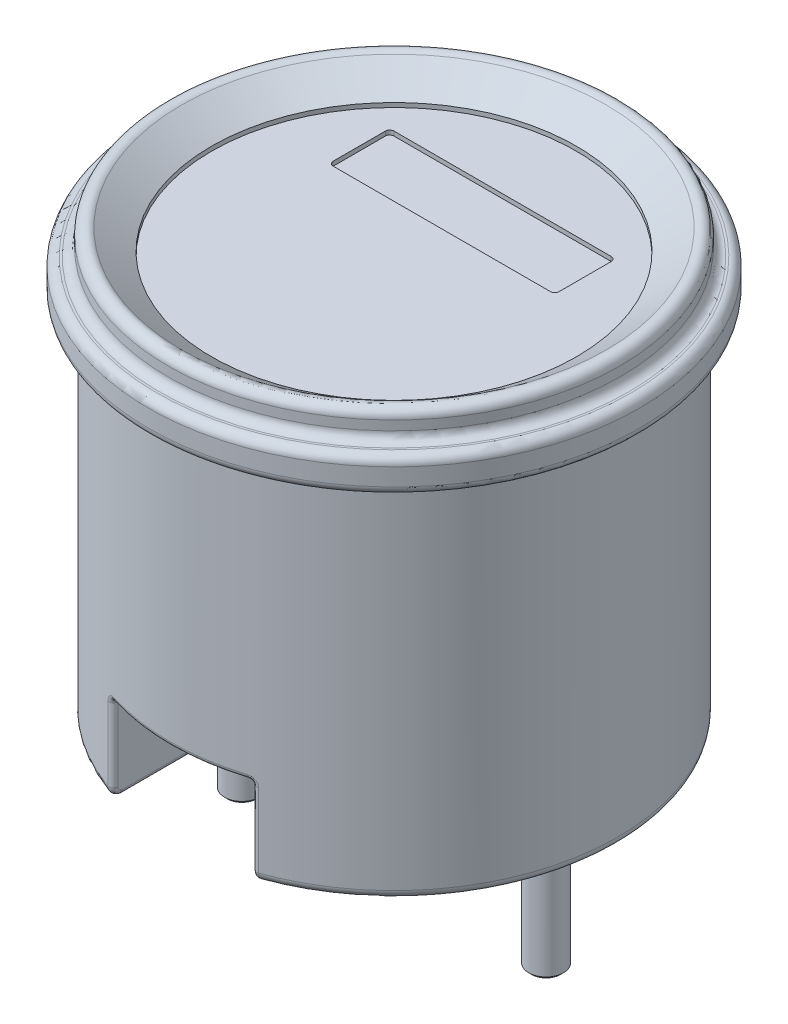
ISO-10303-21;
HEADER;
FILE_DESCRIPTION(('STEP AP214'),'2;1');
FILE_NAME('part.step','',(''),(''),'','','');
FILE_SCHEMA(('AUTOMOTIVE_DESIGN { 1 0 10303 214 1 1 1 1 }'));
ENDSEC;
DATA;
#1=APPLICATION_CONTEXT('core data for automotive mechanical design processes');
#2=APPLICATION_PROTOCOL_DEFINITION('international standard','automotive_design',2000,#1);
#3=PRODUCT_CONTEXT('',#1,'mechanical');
#4=PRODUCT('Part','Part','',(#3));
#5=PRODUCT_RELATED_PRODUCT_CATEGORY('part','',(#4));
#6=PRODUCT_DEFINITION_FORMATION('','',#4);
#7=PRODUCT_DEFINITION_CONTEXT('part definition',#1,'design');
#8=PRODUCT_DEFINITION('design','',#6,#7);
#9=PRODUCT_DEFINITION_SHAPE('','',#8);
#10=(LENGTH_UNIT() NAMED_UNIT(*) SI_UNIT(.MILLI.,.METRE.));
#11=(NAMED_UNIT(*) PLANE_ANGLE_UNIT() SI_UNIT($,.RADIAN.));
#12=(NAMED_UNIT(*) SI_UNIT($,.STERADIAN.) SOLID_ANGLE_UNIT());
#13=UNCERTAINTY_MEASURE_WITH_UNIT(LENGTH_MEASURE(1.E-05),#10,'distance_accuracy_value','');
#14=(GEOMETRIC_REPRESENTATION_CONTEXT(3) GLOBAL_UNCERTAINTY_ASSIGNED_CONTEXT((#13)) GLOBAL_UNIT_ASSIGNED_CONTEXT((#10,
#11,#12)) REPRESENTATION_CONTEXT('',''));
#15=CARTESIAN_POINT('',(0.,0.,0.));
#16=DIRECTION('',(0.,0.,1.));
#17=DIRECTION('',(1.,0.,0.));
#18=AXIS2_PLACEMENT_3D('',#15,#16,#17);
#19=CARTESIAN_POINT('',(0.,-42.,0.));
#20=DIRECTION('',(0.,1.,0.));
#21=DIRECTION('',(-1.,0.,0.));
#22=AXIS2_PLACEMENT_3D('',#19,#20,#21);
#23=PLANE('',#22);
#24=CARTESIAN_POINT('',(0.,-42.,0.));
#25=DIRECTION('',(0.,1.,0.));
#26=DIRECTION('',(-1.,0.,0.));
#27=AXIS2_PLACEMENT_3D('',#24,#25,#26);
#28=CIRCLE('',#27,24.75);
#29=CARTESIAN_POINT('',(-8.49999999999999,-42.,23.2446230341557));
#30=VERTEX_POINT('',#29);
#31=CARTESIAN_POINT('',(8.50000000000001,-42.,23.2446230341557));
#32=VERTEX_POINT('',#31);
#33=EDGE_CURVE('E293',#30,#32,#28,.F.);
#34=ORIENTED_EDGE('',*,*,#33,.T.);
#35=DIRECTION('',(0.,0.,1.));
#36=VECTOR('',#35,1.);
#37=CARTESIAN_POINT('',(8.50000000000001,-42.,0.));
#38=LINE('',#37,#36);
#39=CARTESIAN_POINT('',(8.50000000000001,-42.,13.25));
#40=VERTEX_POINT('',#39);
#41=EDGE_CURVE('E640',#32,#40,#38,.F.);
#42=ORIENTED_EDGE('',*,*,#41,.T.);
#43=CARTESIAN_POINT('',(7.50000000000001,-42.,13.25));
#44=DIRECTION('',(0.,1.,0.));
#45=DIRECTION('',(-1.,0.,0.));
#46=AXIS2_PLACEMENT_3D('',#43,#44,#45);
#47=CIRCLE('',#46,1.);
#48=CARTESIAN_POINT('',(7.50000000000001,-42.,12.25));
#49=VERTEX_POINT('',#48);
#50=EDGE_CURVE('E645',#49,#40,#47,.F.);
#51=ORIENTED_EDGE('',*,*,#50,.F.);
#52=DIRECTION('',(1.,0.,0.));
#53=VECTOR('',#52,1.);
#54=CARTESIAN_POINT('',(0.,-42.,12.25));
#55=LINE('',#54,#53);
#56=CARTESIAN_POINT('',(-7.49999999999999,-42.,12.25));
#57=VERTEX_POINT('',#56);
#58=EDGE_CURVE('E652',#49,#57,#55,.F.);
#59=ORIENTED_EDGE('',*,*,#58,.T.);
#60=CARTESIAN_POINT('',(-7.49999999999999,-42.,13.25));
#61=DIRECTION('',(0.,1.,0.));
#62=DIRECTION('',(-1.,0.,0.));
#63=AXIS2_PLACEMENT_3D('',#60,#61,#62);
#64=CIRCLE('',#63,1.);
#65=CARTESIAN_POINT('',(-8.49999999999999,-42.,13.25));
#66=VERTEX_POINT('',#65);
#67=EDGE_CURVE('E682',#66,#57,#64,.F.);
#68=ORIENTED_EDGE('',*,*,#67,.F.);
#69=DIRECTION('',(0.,0.,-1.));
#70=VECTOR('',#69,1.);
#71=CARTESIAN_POINT('',(-8.49999999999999,-42.,0.));
#72=LINE('',#71,#70);
#73=EDGE_CURVE('E648',#66,#30,#72,.F.);
#74=ORIENTED_EDGE('',*,*,#73,.T.);
#75=EDGE_LOOP('',(#34,#42,#51,#59,#68,#74));
#76=FACE_BOUND('',#75,.T.);
#77=CARTESIAN_POINT('',(17.5,-42.,0.));
#78=DIRECTION('',(0.,1.,0.));
#79=DIRECTION('',(-1.,0.,0.));
#80=AXIS2_PLACEMENT_3D('',#77,#78,#79);
#81=CIRCLE('',#80,2.);
#82=CARTESIAN_POINT('',(15.5,-42.,0.));
#83=VERTEX_POINT('',#82);
#84=EDGE_CURVE('E296',#83,#83,#81,.F.);
#85=ORIENTED_EDGE('',*,*,#84,.F.);
#86=EDGE_LOOP('',(#85));
#87=FACE_BOUND('',#86,.T.);
#88=CARTESIAN_POINT('',(-17.5,-42.,0.));
#89=DIRECTION('',(0.,1.,0.));
#90=DIRECTION('',(-1.,0.,0.));
#91=AXIS2_PLACEMENT_3D('',#88,#89,#90);
#92=CIRCLE('',#91,2.);
#93=CARTESIAN_POINT('',(-19.5,-42.,0.));
#94=VERTEX_POINT('',#93);
#95=EDGE_CURVE('E299',#94,#94,#92,.F.);
#96=ORIENTED_EDGE('',*,*,#95,.F.);
#97=EDGE_LOOP('',(#96));
#98=FACE_BOUND('',#97,.T.);
#99=ADVANCED_FACE('F28',(#76,#87,#98),#23,.F.);
#100=CARTESIAN_POINT('',(0.,8.30312035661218,0.));
#101=DIRECTION('',(0.,1.,0.));
#102=DIRECTION('',(-1.,0.,0.));
#103=AXIS2_PLACEMENT_3D('',#100,#101,#102);
#104=CYLINDRICAL_SURFACE('',#103,25.75);
#105=CARTESIAN_POINT('',(7.32610606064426,-32.0312133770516,24.2158700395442));
#106=CARTESIAN_POINT('',(7.43943849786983,-31.9891733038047,24.652389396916));
#107=CARTESIAN_POINT('',(7.29384008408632,-31.5624267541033,24.6953922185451));
#108=CARTESIAN_POINT('',(7.35402757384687,-32.0208348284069,24.1993861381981));
#109=CARTESIAN_POINT('',(7.47509923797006,-31.9836139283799,24.6414941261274));
#110=CARTESIAN_POINT('',(7.35078891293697,-31.5416696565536,24.6785819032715));
#111=CARTESIAN_POINT('',(7.38277478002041,-32.0130295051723,24.1821860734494));
#112=CARTESIAN_POINT('',(7.51076096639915,-31.9820049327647,24.630526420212));
#113=CARTESIAN_POINT('',(7.40942182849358,-31.5260590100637,24.6610412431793));
#114=CARTESIAN_POINT('',(7.441027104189,-32.0026157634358,24.1468704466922));
#115=CARTESIAN_POINT('',(7.58097359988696,-31.9858092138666,24.608839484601));
#116=CARTESIAN_POINT('',(7.52823349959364,-31.5052315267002,24.6250262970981));
#117=CARTESIAN_POINT('',(7.47053136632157,-32.0000017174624,24.1287558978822));
#118=CARTESIAN_POINT('',(7.61556452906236,-31.9913296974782,24.5981064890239));
#119=CARTESIAN_POINT('',(7.58841050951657,-31.5000034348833,24.6065530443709));
#120=CARTESIAN_POINT('',(7.5293589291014,-31.9999982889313,24.0921584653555));
#121=CARTESIAN_POINT('',(7.68192112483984,-32.0087902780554,24.57746604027));
#122=CARTESIAN_POINT('',(7.7083954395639,-31.4999965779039,24.569230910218));
#123=CARTESIAN_POINT('',(7.55868249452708,-32.0025894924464,24.0736772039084));
#124=CARTESIAN_POINT('',(7.71369352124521,-32.0208319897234,24.5675557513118));
#125=CARTESIAN_POINT('',(7.76820389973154,-31.5051789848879,24.5503836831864));
#126=CARTESIAN_POINT('',(7.61644227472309,-32.0128642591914,24.0368189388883));
#127=CARTESIAN_POINT('',(7.77320502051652,-32.0502567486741,24.5490120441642));
#128=CARTESIAN_POINT('',(7.88601097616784,-31.5257285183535,24.5127955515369));
#129=CARTESIAN_POINT('',(7.64487845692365,-32.0205480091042,24.0184419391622));
#130=CARTESIAN_POINT('',(7.80089034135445,-32.0677553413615,24.5403957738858));
#131=CARTESIAN_POINT('',(7.94400952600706,-31.5410960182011,24.4940546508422));
#132=CARTESIAN_POINT('',(7.70008108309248,-32.0408344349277,23.9823542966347));
#133=CARTESIAN_POINT('',(7.8511510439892,-32.1066906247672,24.5248562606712));
#134=CARTESIAN_POINT('',(8.05660102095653,-31.5816688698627,24.457252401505));
#135=CARTESIAN_POINT('',(7.72684627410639,-32.0534407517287,23.9646441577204));
#136=CARTESIAN_POINT('',(7.8736222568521,-32.1282143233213,24.5179676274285));
#137=CARTESIAN_POINT('',(8.11119141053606,-31.6068815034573,24.4391915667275));
#138=CARTESIAN_POINT('',(7.77788688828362,-32.0832838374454,23.9305224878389));
#139=CARTESIAN_POINT('',(7.91277317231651,-32.1734188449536,24.5061620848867));
#140=CARTESIAN_POINT('',(8.21529404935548,-31.6665676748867,24.4043942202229));
#141=CARTESIAN_POINT('',(7.80216283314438,-32.1005196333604,23.914110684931));
#142=CARTESIAN_POINT('',(7.92932102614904,-32.1971303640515,24.5012895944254));
#143=CARTESIAN_POINT('',(8.26480736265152,-31.7010392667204,24.3876574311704));
#144=CARTESIAN_POINT('',(7.84704919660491,-32.1388727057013,23.8834977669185));
#145=CARTESIAN_POINT('',(7.95636342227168,-32.2443404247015,24.4936117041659));
#146=CARTESIAN_POINT('',(8.35635776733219,-31.7777454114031,24.3564383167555));
#147=CARTESIAN_POINT('',(7.86771647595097,-32.1599165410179,23.8692629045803));
#148=CARTESIAN_POINT('',(7.96682858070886,-32.267809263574,24.4908153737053));
#149=CARTESIAN_POINT('',(8.39851083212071,-31.8198330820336,24.3419215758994));
#150=CARTESIAN_POINT('',(7.90517631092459,-32.2055468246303,23.8432824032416));
#151=CARTESIAN_POINT('',(7.9828619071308,-32.3132339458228,24.486880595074));
#152=CARTESIAN_POINT('',(8.47491405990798,-31.911093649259,24.3154266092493));
#153=CARTESIAN_POINT('',(7.92196977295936,-32.2301324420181,23.8315361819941));
#154=CARTESIAN_POINT('',(7.98831916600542,-32.3350986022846,24.4857775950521));
#155=CARTESIAN_POINT('',(8.50916607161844,-31.9602648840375,24.3034477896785));
#156=CARTESIAN_POINT('',(7.95029687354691,-32.280834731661,23.8116228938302));
#157=CARTESIAN_POINT('',(7.99556355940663,-32.3751532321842,24.4846915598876));
#158=CARTESIAN_POINT('',(8.56694213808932,-32.0616694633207,24.2831401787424));
#159=CARTESIAN_POINT('',(7.96205200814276,-32.3068128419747,23.8033059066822));
#160=CARTESIAN_POINT('',(7.99746351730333,-32.3933773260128,24.4846713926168));
#161=CARTESIAN_POINT('',(8.59091795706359,-32.1136256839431,24.2746584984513));
#162=CARTESIAN_POINT('',(7.98100946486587,-32.3605686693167,23.7898538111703));
#163=CARTESIAN_POINT('',(7.99964179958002,-32.4273759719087,24.4849955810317));
#164=CARTESIAN_POINT('',(8.62958366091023,-32.2211373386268,24.2609400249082));
#165=CARTESIAN_POINT('',(7.98821419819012,-32.3883454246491,23.7847170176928));
#166=CARTESIAN_POINT('',(7.9998990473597,-32.4430466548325,24.4853427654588));
#167=CARTESIAN_POINT('',(8.64427846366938,-32.2766908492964,24.2557015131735));
#168=CARTESIAN_POINT('',(7.99751520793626,-32.4433101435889,23.7780792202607));
#169=CARTESIAN_POINT('',(8.00007182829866,-32.4720788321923,24.4858576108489));
#170=CARTESIAN_POINT('',(8.66324883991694,-32.3866202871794,24.2489322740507));
#171=CARTESIAN_POINT('',(7.99986400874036,-32.4704501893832,23.7763985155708));
#172=CARTESIAN_POINT('',(8.00000289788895,-32.4854454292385,24.4860319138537));
#173=CARTESIAN_POINT('',(8.66803946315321,-32.4409003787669,24.2472182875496));
#174=CARTESIAN_POINT('',(8.00012455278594,-32.5247668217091,23.776212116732));
#175=CARTESIAN_POINT('',(7.99999727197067,-32.5122007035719,24.4860504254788));
#176=CARTESIAN_POINT('',(8.66857086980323,-32.5495336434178,24.2470281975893));
#177=CARTESIAN_POINT('',(7.99803481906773,-32.5519434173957,23.7777074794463));
#178=CARTESIAN_POINT('',(8.00006065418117,-32.5255218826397,24.4858944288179));
#179=CARTESIAN_POINT('',(8.66430864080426,-32.6038868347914,24.2485531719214));
#180=CARTESIAN_POINT('',(7.98959565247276,-32.6048575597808,23.783731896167));
#181=CARTESIAN_POINT('',(7.999941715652,-32.5532868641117,24.4854124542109));
#182=CARTESIAN_POINT('',(8.64709608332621,-32.7097151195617,24.2546968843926));
#183=CARTESIAN_POINT('',(7.9833501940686,-32.6306140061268,23.7881868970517));
#184=CARTESIAN_POINT('',(7.99976666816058,-32.5676238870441,24.4850925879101));
#185=CARTESIAN_POINT('',(8.63435782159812,-32.7612280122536,24.2592401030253));
#186=CARTESIAN_POINT('',(7.96695778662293,-32.6806973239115,23.7998281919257));
#187=CARTESIAN_POINT('',(7.99810843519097,-32.5983693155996,24.4847216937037));
#188=CARTESIAN_POINT('',(8.60092380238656,-32.8613946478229,24.2711119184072));
#189=CARTESIAN_POINT('',(7.95681015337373,-32.7050239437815,23.8070149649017));
#190=CARTESIAN_POINT('',(7.99663992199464,-32.6146983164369,24.4846690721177));
#191=CARTESIAN_POINT('',(8.58022664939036,-32.9100478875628,24.2784410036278));
#192=CARTESIAN_POINT('',(7.94483924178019,-32.7282937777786,23.8154528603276));
#193=CARTESIAN_POINT('',(7.99400786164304,-32.6324868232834,24.4849572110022));
#194=CARTESIAN_POINT('',(8.5558107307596,-32.9565875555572,24.2870459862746));
#195=(BOUNDED_SURFACE() B_SPLINE_SURFACE(3,2,((#105,#106,#107),(#108,#109,#110),(#111,#112,
#113),(#114,#115,#116),(#117,#118,#119),(#120,#121,#122),(#123,#124,#125),(#126,#127,#128),
(#129,#130,#131),(#132,#133,#134),(#135,#136,#137),(#138,#139,#140),(#141,#142,#143),(#144,#145,
#146),(#147,#148,#149),(#150,#151,#152),(#153,#154,#155),(#156,#157,#158),(#159,#160,#161),
(#162,#163,#164),(#165,#166,#167),(#168,#169,#170),(#171,#172,#173),(#174,#175,#176),(#177,#178,
#179),(#180,#181,#182),(#183,#184,#185),(#186,#187,#188),(#189,#190,#191),(#192,#193,#194)),
.UNSPECIFIED.,.F.,.F.,.F.) B_SPLINE_SURFACE_WITH_KNOTS((4,2,2,2,2,2,2,2,2,2,2,2,2,2,4),(3,3),
(0.,0.185148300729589,0.370095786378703,0.55435475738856,0.738620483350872,0.92302275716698,
1.10738630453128,1.28851375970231,1.46959879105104,1.64160484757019,1.81351968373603,
1.9762432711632,2.13902101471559,2.29787200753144,2.45675086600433),(0.,1.),
.UNSPECIFIED.) GEOMETRIC_REPRESENTATION_ITEM() RATIONAL_B_SPLINE_SURFACE(((1.,0.741118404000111,
1.),(1.,0.736048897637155,1.),(1.,0.730638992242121,1.),(1.,0.719262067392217,1.),(1.,
0.713295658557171,1.),(1.,0.70094094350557,1.),(1.,0.694554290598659,1.),(1.,0.681503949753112,
1.),(1.,0.674840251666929,1.),(1.,0.661441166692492,1.),(1.,0.654705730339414,1.),(1.,
0.641434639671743,1.),(1.,0.634898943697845,1.),(1.,0.622457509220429,1.),(1.,0.616542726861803,
1.),(1.,0.605561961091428,1.),(1.,0.600495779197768,1.),(1.,0.591794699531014,1.),(1.,
0.588100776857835,1.),(1.,0.582079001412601,1.),(1.,0.579750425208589,1.),(1.,0.576733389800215,
1.),(1.,0.57596389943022,1.),(1.,0.575878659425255,1.),(1.,0.576563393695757,1.),(1.,
0.579303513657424,1.),(1.,0.581325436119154,1.),(1.,0.586548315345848,1.),(1.,0.589749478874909,
1.),(1.,0.593460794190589,1.))) REPRESENTATION_ITEM('') SURFACE());
#196=CARTESIAN_POINT('',(8.5558107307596,-32.9565875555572,24.2870459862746));
#197=CARTESIAN_POINT('',(8.58022664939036,-32.9100478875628,24.2784410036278));
#198=CARTESIAN_POINT('',(8.60092380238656,-32.8613946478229,24.2711119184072));
#199=CARTESIAN_POINT('',(8.63435782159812,-32.7612280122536,24.2592401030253));
#200=CARTESIAN_POINT('',(8.64709608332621,-32.7097151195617,24.2546968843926));
#201=CARTESIAN_POINT('',(8.66430864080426,-32.6038868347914,24.2485531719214));
#202=CARTESIAN_POINT('',(8.66857086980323,-32.5495336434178,24.2470281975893));
#203=CARTESIAN_POINT('',(8.66803946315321,-32.4409003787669,24.2472182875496));
#204=CARTESIAN_POINT('',(8.66324883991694,-32.3866202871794,24.2489322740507));
#205=CARTESIAN_POINT('',(8.64427846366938,-32.2766908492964,24.2557015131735));
#206=CARTESIAN_POINT('',(8.62958366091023,-32.2211373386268,24.2609400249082));
#207=CARTESIAN_POINT('',(8.59091795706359,-32.1136256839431,24.2746584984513));
#208=CARTESIAN_POINT('',(8.56694213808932,-32.0616694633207,24.2831401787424));
#209=CARTESIAN_POINT('',(8.50916607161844,-31.9602648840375,24.3034477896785));
#210=CARTESIAN_POINT('',(8.47491405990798,-31.911093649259,24.3154266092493));
#211=CARTESIAN_POINT('',(8.39851083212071,-31.8198330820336,24.3419215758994));
#212=CARTESIAN_POINT('',(8.35635776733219,-31.7777454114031,24.3564383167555));
#213=CARTESIAN_POINT('',(8.26480736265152,-31.7010392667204,24.3876574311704));
#214=CARTESIAN_POINT('',(8.21529404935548,-31.6665676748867,24.4043942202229));
#215=CARTESIAN_POINT('',(8.11119141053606,-31.6068815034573,24.4391915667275));
#216=CARTESIAN_POINT('',(8.05660102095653,-31.5816688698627,24.457252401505));
#217=CARTESIAN_POINT('',(7.94400952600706,-31.5410960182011,24.4940546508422));
#218=CARTESIAN_POINT('',(7.88601097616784,-31.5257285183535,24.5127955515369));
#219=CARTESIAN_POINT('',(7.76820389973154,-31.5051789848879,24.5503836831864));
#220=CARTESIAN_POINT('',(7.7083954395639,-31.4999965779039,24.569230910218));
#221=CARTESIAN_POINT('',(7.58841050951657,-31.5000034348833,24.6065530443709));
#222=CARTESIAN_POINT('',(7.52823349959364,-31.5052315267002,24.6250262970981));
#223=CARTESIAN_POINT('',(7.40942182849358,-31.5260590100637,24.6610412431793));
#224=CARTESIAN_POINT('',(7.35078891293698,-31.5416696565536,24.6785819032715));
#225=CARTESIAN_POINT('',(7.29384008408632,-31.5624267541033,24.6953922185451));
#226=B_SPLINE_CURVE_WITH_KNOTS('',3,(#196,#197,#198,#199,#200,#201,#202,#203,#204,#205,#206,
#207,#208,#209,#210,#211,#212,#213,#214,#215,#216,#217,#218,#219,#220,#221,#222,#223,#224,#225),
.UNSPECIFIED.,.F.,.F.,(4,2,2,2,2,2,2,2,2,2,2,2,2,2,4),(0.,0.158878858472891,0.31772985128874,
0.480507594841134,0.643231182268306,0.815146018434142,0.987152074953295,1.16823710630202,
1.34936456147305,1.53372810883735,1.71813038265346,1.90239610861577,2.08665507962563,
2.27160256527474,2.45675086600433),.UNSPECIFIED.);
#227=CARTESIAN_POINT('',(8.66831683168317,-32.5,24.2471190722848));
#228=VERTEX_POINT('',#227);
#229=CARTESIAN_POINT('',(7.64851485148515,-31.5,24.5878571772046));
#230=VERTEX_POINT('',#229);
#231=EDGE_CURVE('E698',#228,#230,#226,.T.);
#232=ORIENTED_EDGE('',*,*,#231,.F.);
#233=DIRECTION('',(0.,1.,0.));
#234=VECTOR('',#233,1.);
#235=CARTESIAN_POINT('',(8.66831683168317,8.30312035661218,24.2471190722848));
#236=LINE('',#235,#234);
#237=CARTESIAN_POINT('',(8.66831683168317,-41.,24.2471190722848));
#238=VERTEX_POINT('',#237);
#239=EDGE_CURVE('E704',#228,#238,#236,.F.);
#240=ORIENTED_EDGE('',*,*,#239,.T.);
#241=CARTESIAN_POINT('',(0.,-41.,0.));
#242=DIRECTION('',(0.,1.,0.));
#243=DIRECTION('',(-1.,0.,0.));
#244=AXIS2_PLACEMENT_3D('',#241,#242,#243);
#245=CIRCLE('',#244,25.75);
#246=CARTESIAN_POINT('',(-8.66831683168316,-41.,24.2471190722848));
#247=VERTEX_POINT('',#246);
#248=EDGE_CURVE('E290',#238,#247,#245,.T.);
#249=ORIENTED_EDGE('',*,*,#248,.T.);
#250=DIRECTION('',(0.,1.,0.));
#251=VECTOR('',#250,1.);
#252=CARTESIAN_POINT('',(-8.66831683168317,8.30312035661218,24.2471190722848));
#253=LINE('',#252,#251);
#254=CARTESIAN_POINT('',(-8.66831683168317,-32.5,24.2471190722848));
#255=VERTEX_POINT('',#254);
#256=EDGE_CURVE('E322',#247,#255,#253,.T.);
#257=ORIENTED_EDGE('',*,*,#256,.T.);
#258=CARTESIAN_POINT('',(-7.97497445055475,-32.6562026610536,23.7941350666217));
#259=CARTESIAN_POINT('',(-7.99891602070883,-32.5834021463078,24.4849021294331));
#260=CARTESIAN_POINT('',(-8.61727462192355,-32.8124053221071,24.26530605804));
#261=CARTESIAN_POINT('',(-7.98324317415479,-32.6311494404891,23.7882571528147));
#262=CARTESIAN_POINT('',(-7.99962816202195,-32.5678115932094,24.4851381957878));
#263=CARTESIAN_POINT('',(-8.63413954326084,-32.7622988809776,24.2593117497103));
#264=CARTESIAN_POINT('',(-7.98950074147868,-32.6053517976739,23.7837980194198));
#265=CARTESIAN_POINT('',(-7.99990398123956,-32.5535232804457,24.485420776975));
#266=CARTESIAN_POINT('',(-8.64690250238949,-32.7107035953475,24.2547643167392));
#267=CARTESIAN_POINT('',(-7.99787620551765,-32.5530362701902,23.7778223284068));
#268=CARTESIAN_POINT('',(-8.00009483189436,-32.5261193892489,24.4858715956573));
#269=CARTESIAN_POINT('',(-8.66398513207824,-32.6060725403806,24.2486702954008));
#270=CARTESIAN_POINT('',(-7.99999817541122,-32.5265191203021,23.7763028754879));
#271=CARTESIAN_POINT('',(-8.00000808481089,-32.5130708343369,24.4860383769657));
#272=CARTESIAN_POINT('',(-8.6683131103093,-32.5530382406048,24.2471207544));
#273=CARTESIAN_POINT('',(-8.00000185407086,-32.4730523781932,23.7762995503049));
#274=CARTESIAN_POINT('',(-7.99999178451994,-32.486717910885,24.4860447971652));
#275=CARTESIAN_POINT('',(-8.66832061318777,-32.4461047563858,24.2471173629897));
#276=CARTESIAN_POINT('',(-7.9978144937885,-32.4461027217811,23.7778651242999));
#277=CARTESIAN_POINT('',(-8.00006483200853,-32.4734784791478,24.4858790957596));
#278=CARTESIAN_POINT('',(-8.66385926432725,-32.3922054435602,24.2487139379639));
#279=CARTESIAN_POINT('',(-7.98915677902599,-32.39300070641,23.784044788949));
#280=CARTESIAN_POINT('',(-7.99992759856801,-32.4455650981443,24.4853904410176));
#281=CARTESIAN_POINT('',(-8.64620095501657,-32.2860014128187,24.2550159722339));
#282=CARTESIAN_POINT('',(-7.98268736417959,-32.3668481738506,23.7886582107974));
#283=CARTESIAN_POINT('',(-7.99971907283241,-32.4309644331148,24.4850694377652));
#284=CARTESIAN_POINT('',(-8.63300591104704,-32.2336963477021,24.2597207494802));
#285=CARTESIAN_POINT('',(-7.96572553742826,-32.3161140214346,23.8007027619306));
#286=CARTESIAN_POINT('',(-7.99796541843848,-32.399513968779,24.4847020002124));
#287=CARTESIAN_POINT('',(-8.59841050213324,-32.1322280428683,24.272003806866));
#288=CARTESIAN_POINT('',(-7.95524069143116,-32.2915295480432,23.8081285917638));
#289=CARTESIAN_POINT('',(-7.99643862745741,-32.3827543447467,24.4846533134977));
#290=CARTESIAN_POINT('',(-8.577025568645,-32.0830590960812,24.2795766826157));
#291=CARTESIAN_POINT('',(-7.9305979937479,-32.2444771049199,23.8254817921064));
#292=CARTESIAN_POINT('',(-7.99074038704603,-32.3468876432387,24.4853611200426));
#293=CARTESIAN_POINT('',(-8.52676422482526,-31.9889542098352,24.2972735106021));
#294=CARTESIAN_POINT('',(-7.9164347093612,-32.2220123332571,23.835412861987));
#295=CARTESIAN_POINT('',(-7.98660791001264,-32.3278657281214,24.4861074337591));
#296=CARTESIAN_POINT('',(-8.49787673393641,-31.9440246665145,24.3074012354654));
#297=CARTESIAN_POINT('',(-7.88448799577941,-32.1792195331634,23.8576550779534));
#298=CARTESIAN_POINT('',(-7.97440032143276,-32.287686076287,24.488899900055));
#299=CARTESIAN_POINT('',(-8.43271809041,-31.8584390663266,24.3300838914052));
#300=CARTESIAN_POINT('',(-7.8666210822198,-32.1589610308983,23.8700207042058));
#301=CARTESIAN_POINT('',(-7.96630136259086,-32.2665556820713,24.4909553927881));
#302=CARTESIAN_POINT('',(-8.39627666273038,-31.8179220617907,24.3426943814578));
#303=CARTESIAN_POINT('',(-7.82803845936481,-32.1217002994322,23.8964970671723));
#304=CARTESIAN_POINT('',(-7.94535436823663,-32.2238541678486,24.4966935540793));
#305=CARTESIAN_POINT('',(-8.31758339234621,-31.7434005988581,24.3696950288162));
#306=CARTESIAN_POINT('',(-7.80732164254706,-32.1046993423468,23.9106084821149));
#307=CARTESIAN_POINT('',(-7.93260328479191,-32.2023249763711,24.5003441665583));
#308=CARTESIAN_POINT('',(-8.27532929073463,-31.7093986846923,24.3840858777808));
#309=CARTESIAN_POINT('',(-7.76239854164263,-32.0734606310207,23.9409167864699));
#310=CARTESIAN_POINT('',(-7.9013236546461,-32.159191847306,24.509585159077));
#311=CARTESIAN_POINT('',(-8.18370395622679,-31.6469212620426,24.4149943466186));
#312=CARTESIAN_POINT('',(-7.73806306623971,-32.0594260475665,23.9571856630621));
#313=CARTESIAN_POINT('',(-7.88261583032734,-32.1376241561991,24.5152368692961));
#314=CARTESIAN_POINT('',(-8.13406922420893,-31.6188520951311,24.4315853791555));
#315=CARTESIAN_POINT('',(-7.68754904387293,-32.0356682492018,23.9905847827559));
#316=CARTESIAN_POINT('',(-7.84006476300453,-32.0973879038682,24.5282686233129));
#317=CARTESIAN_POINT('',(-8.0310406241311,-31.5713364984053,24.4656458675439));
#318=CARTESIAN_POINT('',(-7.66137240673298,-32.0259406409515,24.0077141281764));
#319=CARTESIAN_POINT('',(-7.81632781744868,-32.0786655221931,24.5356130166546));
#320=CARTESIAN_POINT('',(-7.97765065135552,-31.5518812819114,24.4831144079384));
#321=CARTESIAN_POINT('',(-7.60662710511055,-32.0106395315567,24.0431208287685));
#322=CARTESIAN_POINT('',(-7.76338119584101,-32.0448062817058,24.5520659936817));
#323=CARTESIAN_POINT('',(-7.86599191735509,-31.5212790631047,24.5192222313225));
#324=CARTESIAN_POINT('',(-7.57800382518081,-32.005270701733,24.061415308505));
#325=CARTESIAN_POINT('',(-7.73402742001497,-32.0297562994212,24.5612209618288));
#326=CARTESIAN_POINT('',(-7.80761176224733,-31.5105414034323,24.5378789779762));
#327=CARTESIAN_POINT('',(-7.52023921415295,-31.999566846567,24.0978705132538));
#328=CARTESIAN_POINT('',(-7.67187435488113,-32.005616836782,24.5805902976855));
#329=CARTESIAN_POINT('',(-7.68979483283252,-31.4991336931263,24.5750560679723));
#330=CARTESIAN_POINT('',(-7.49109786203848,-31.9992320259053,24.1160312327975));
#331=CARTESIAN_POINT('',(-7.63910588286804,-31.9964095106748,24.5907953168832));
#332=CARTESIAN_POINT('',(-7.63035801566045,-31.4984640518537,24.5935764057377));
#333=CARTESIAN_POINT('',(-7.43270097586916,-32.0036754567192,24.1519586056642));
#334=CARTESIAN_POINT('',(-7.57115703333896,-31.984745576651,24.6118764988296));
#335=CARTESIAN_POINT('',(-7.51125149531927,-31.5073509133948,24.6302152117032));
#336=CARTESIAN_POINT('',(-7.40344932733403,-32.0085236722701,24.1697164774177));
#337=CARTESIAN_POINT('',(-7.53592803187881,-31.9822588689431,24.6227679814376));
#338=CARTESIAN_POINT('',(-7.45158971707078,-31.5170473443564,24.6483247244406));
#339=CARTESIAN_POINT('',(-7.34606657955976,-32.023355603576,24.2041202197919));
#340=CARTESIAN_POINT('',(-7.46515479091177,-31.984650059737,24.6445381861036));
#341=CARTESIAN_POINT('',(-7.33455163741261,-31.5467112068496,24.6834097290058));
#342=CARTESIAN_POINT('',(-7.31793701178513,-32.0333460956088,24.2207645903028));
#343=CARTESIAN_POINT('',(-7.42955573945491,-31.9894316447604,24.6554352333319));
#344=CARTESIAN_POINT('',(-7.27717845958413,-31.5666921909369,24.7003836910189));
#345=CARTESIAN_POINT('',(-7.29082410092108,-32.0458574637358,24.2365995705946));
#346=CARTESIAN_POINT('',(-7.39436341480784,-31.9981677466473,24.6661342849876));
#347=CARTESIAN_POINT('',(-7.22187885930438,-31.5917149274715,24.7165322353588));
#348=(BOUNDED_SURFACE() B_SPLINE_SURFACE(3,2,((#258,#259,#260),(#261,#262,#263),(#264,#265,
#266),(#267,#268,#269),(#270,#271,#272),(#273,#274,#275),(#276,#277,#278),(#279,#280,#281),
(#282,#283,#284),(#285,#286,#287),(#288,#289,#290),(#291,#292,#293),(#294,#295,#296),(#297,#298,
#299),(#300,#301,#302),(#303,#304,#305),(#306,#307,#308),(#309,#310,#311),(#312,#313,#314),
(#315,#316,#317),(#318,#319,#320),(#321,#322,#323),(#324,#325,#326),(#327,#328,#329),(#330,#331,
#332),(#333,#334,#335),(#336,#337,#338),(#339,#340,#341),(#342,#343,#344),(#345,#346,#347)),
.UNSPECIFIED.,.F.,.F.,.F.) B_SPLINE_SURFACE_WITH_KNOTS((4,2,2,2,2,2,2,2,2,2,2,2,2,2,4),(3,3),
(0.,0.159084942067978,0.318013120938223,0.479509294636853,0.640970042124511,0.802128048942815,
0.963525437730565,1.12905965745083,1.29465838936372,1.46935671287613,1.64387642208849,
1.82618139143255,2.00849377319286,2.19329857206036,2.37834752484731),(0.,1.),
.UNSPECIFIED.) GEOMETRIC_REPRESENTATION_ITEM() RATIONAL_B_SPLINE_SURFACE(((1.,0.583994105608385,
1.),(1.,0.581350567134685,1.),(1.,0.579331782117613,1.),(1.,0.576617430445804,1.),(1.,
0.575920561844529,1.),(1.,0.575918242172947,1.),(1.,0.576635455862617,1.),(1.,0.579445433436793,
1.),(1.,0.581537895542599,1.),(1.,0.586939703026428,1.),(1.,0.590246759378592,1.),(1.,
0.597862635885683,1.),(1.,0.602172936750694,1.),(1.,0.611661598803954,1.),(1.,0.616859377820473,
1.),(1.,0.6277727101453,1.),(1.,0.633488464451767,1.),(1.,0.645512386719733,1.),(1.,
0.651835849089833,1.),(1.,0.664527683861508,1.),(1.,0.670896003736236,1.),(1.,0.683763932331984,
1.),(1.,0.690256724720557,1.),(1.,0.702895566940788,1.),(1.,0.709041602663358,1.),(1.,
0.720926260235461,1.),(1.,0.726658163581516,1.),(1.,0.737525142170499,1.),(1.,0.742659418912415,
1.),(1.,0.747439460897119,1.))) REPRESENTATION_ITEM('') SURFACE());
#349=CARTESIAN_POINT('',(-7.22187885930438,-31.5917149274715,24.7165322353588));
#350=CARTESIAN_POINT('',(-7.27717845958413,-31.5666921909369,24.7003836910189));
#351=CARTESIAN_POINT('',(-7.33455163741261,-31.5467112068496,24.6834097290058));
#352=CARTESIAN_POINT('',(-7.45158971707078,-31.5170473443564,24.6483247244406));
#353=CARTESIAN_POINT('',(-7.51125149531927,-31.5073509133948,24.6302152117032));
#354=CARTESIAN_POINT('',(-7.63035801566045,-31.4984640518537,24.5935764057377));
#355=CARTESIAN_POINT('',(-7.68979483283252,-31.4991336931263,24.5750560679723));
#356=CARTESIAN_POINT('',(-7.80761176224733,-31.5105414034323,24.5378789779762));
#357=CARTESIAN_POINT('',(-7.86599191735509,-31.5212790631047,24.5192222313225));
#358=CARTESIAN_POINT('',(-7.97765065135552,-31.5518812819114,24.4831144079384));
#359=CARTESIAN_POINT('',(-8.0310406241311,-31.5713364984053,24.4656458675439));
#360=CARTESIAN_POINT('',(-8.13406922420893,-31.6188520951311,24.4315853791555));
#361=CARTESIAN_POINT('',(-8.18370395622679,-31.6469212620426,24.4149943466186));
#362=CARTESIAN_POINT('',(-8.27532929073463,-31.7093986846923,24.3840858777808));
#363=CARTESIAN_POINT('',(-8.31758339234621,-31.7434005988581,24.3696950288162));
#364=CARTESIAN_POINT('',(-8.39627666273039,-31.8179220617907,24.3426943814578));
#365=CARTESIAN_POINT('',(-8.43271809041,-31.8584390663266,24.3300838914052));
#366=CARTESIAN_POINT('',(-8.49787673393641,-31.9440246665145,24.3074012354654));
#367=CARTESIAN_POINT('',(-8.52676422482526,-31.9889542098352,24.2972735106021));
#368=CARTESIAN_POINT('',(-8.577025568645,-32.0830590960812,24.2795766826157));
#369=CARTESIAN_POINT('',(-8.59841050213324,-32.1322280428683,24.272003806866));
#370=CARTESIAN_POINT('',(-8.63300591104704,-32.2336963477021,24.2597207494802));
#371=CARTESIAN_POINT('',(-8.64620095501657,-32.2860014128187,24.2550159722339));
#372=CARTESIAN_POINT('',(-8.66385926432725,-32.3922054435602,24.2487139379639));
#373=CARTESIAN_POINT('',(-8.66832061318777,-32.4461047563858,24.2471173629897));
#374=CARTESIAN_POINT('',(-8.6683131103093,-32.5530382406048,24.2471207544));
#375=CARTESIAN_POINT('',(-8.66398513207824,-32.6060725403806,24.2486702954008));
#376=CARTESIAN_POINT('',(-8.64690250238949,-32.7107035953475,24.2547643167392));
#377=CARTESIAN_POINT('',(-8.63413954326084,-32.7622988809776,24.2593117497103));
#378=CARTESIAN_POINT('',(-8.61727462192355,-32.8124053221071,24.26530605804));
#379=B_SPLINE_CURVE_WITH_KNOTS('',3,(#349,#350,#351,#352,#353,#354,#355,#356,#357,#358,#359,
#360,#361,#362,#363,#364,#365,#366,#367,#368,#369,#370,#371,#372,#373,#374,#375,#376,#377,#378),
.UNSPECIFIED.,.F.,.F.,(4,2,2,2,2,2,2,2,2,2,2,2,2,2,4),(0.,0.185048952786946,0.369853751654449,
0.552166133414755,0.734471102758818,0.908990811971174,1.08368913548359,1.24928786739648,
1.41482208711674,1.57621947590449,1.7373774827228,1.89883823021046,2.06033440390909,
2.21926258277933,2.37834752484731),.UNSPECIFIED.);
#380=CARTESIAN_POINT('',(-7.64851485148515,-31.5,24.5878571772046));
#381=VERTEX_POINT('',#380);
#382=EDGE_CURVE('E314',#381,#255,#379,.T.);
#383=ORIENTED_EDGE('',*,*,#382,.F.);
#384=CARTESIAN_POINT('',(0.,-31.5,0.));
#385=DIRECTION('',(0.,-1.,0.));
#386=DIRECTION('',(0.,0.,-1.));
#387=AXIS2_PLACEMENT_3D('',#384,#385,#386);
#388=CIRCLE('',#387,25.75);
#389=EDGE_CURVE('E705',#381,#230,#388,.F.);
#390=ORIENTED_EDGE('',*,*,#389,.T.);
#391=EDGE_LOOP('',(#232,#240,#249,#257,#383,#390));
#392=FACE_BOUND('',#391,.T.);
#393=CARTESIAN_POINT('',(0.,0.,0.));
#394=DIRECTION('',(0.,1.,0.));
#395=DIRECTION('',(-1.,0.,0.));
#396=AXIS2_PLACEMENT_3D('',#393,#394,#395);
#397=CIRCLE('',#396,25.75);
#398=CARTESIAN_POINT('',(-25.75,0.,0.));
#399=VERTEX_POINT('',#398);
#400=EDGE_CURVE('E263',#399,#399,#397,.T.);
#401=ORIENTED_EDGE('',*,*,#400,.F.);
#402=EDGE_LOOP('',(#401));
#403=FACE_BOUND('',#402,.T.);
#404=ADVANCED_FACE('F328',(#392,#403),#104,.T.);
#405=CARTESIAN_POINT('',(25.75,0.,0.));
#406=DIRECTION('',(0.,1.,0.));
#407=DIRECTION('',(-1.,0.,0.));
#408=AXIS2_PLACEMENT_3D('',#405,#406,#407);
#409=PLANE('',#408);
#410=CARTESIAN_POINT('',(0.,0.,0.));
#411=DIRECTION('',(0.,1.,0.));
#412=DIRECTION('',(-1.,0.,0.));
#413=AXIS2_PLACEMENT_3D('',#410,#411,#412);
#414=CIRCLE('',#413,27.25);
#415=CARTESIAN_POINT('',(-27.25,0.,0.));
#416=VERTEX_POINT('',#415);
#417=EDGE_CURVE('E287',#416,#416,#414,.F.);
#418=ORIENTED_EDGE('',*,*,#417,.T.);
#419=EDGE_LOOP('',(#418));
#420=FACE_BOUND('',#419,.T.);
#421=ORIENTED_EDGE('',*,*,#400,.T.);
#422=EDGE_LOOP('',(#421));
#423=FACE_BOUND('',#422,.T.);
#424=ADVANCED_FACE('F332',(#420,#423),#409,.F.);
#425=CARTESIAN_POINT('',(0.,8.30312035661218,0.));
#426=DIRECTION('',(0.,1.,0.));
#427=DIRECTION('',(-1.,0.,0.));
#428=AXIS2_PLACEMENT_3D('',#425,#426,#427);
#429=CYLINDRICAL_SURFACE('',#428,28.25);
#430=CARTESIAN_POINT('',(0.,0.999999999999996,0.));
#431=DIRECTION('',(0.,1.,0.));
#432=DIRECTION('',(-1.,0.,0.));
#433=AXIS2_PLACEMENT_3D('',#430,#431,#432);
#434=CIRCLE('',#433,28.25);
#435=CARTESIAN_POINT('',(-28.25,0.99999999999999,0.));
#436=VERTEX_POINT('',#435);
#437=EDGE_CURVE('E284',#436,#436,#434,.T.);
#438=ORIENTED_EDGE('',*,*,#437,.T.);
#439=EDGE_LOOP('',(#438));
#440=FACE_BOUND('',#439,.T.);
#441=CARTESIAN_POINT('',(0.,2.99999999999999,0.));
#442=DIRECTION('',(0.,-1.,0.));
#443=DIRECTION('',(1.,0.,0.));
#444=AXIS2_PLACEMENT_3D('',#441,#442,#443);
#445=CIRCLE('',#444,28.25);
#446=CARTESIAN_POINT('',(28.25,3.,0.));
#447=VERTEX_POINT('',#446);
#448=EDGE_CURVE('E281',#447,#447,#445,.T.);
#449=ORIENTED_EDGE('',*,*,#448,.T.);
#450=EDGE_LOOP('',(#449));
#451=FACE_BOUND('',#450,.T.);
#452=ADVANCED_FACE('F943',(#440,#451),#429,.T.);
#453=CARTESIAN_POINT('',(28.25,4.,0.));
#454=DIRECTION('',(0.,-1.,0.));
#455=DIRECTION('',(1.,0.,0.));
#456=AXIS2_PLACEMENT_3D('',#453,#454,#455);
#457=PLANE('',#456);
#458=CARTESIAN_POINT('',(0.,3.99999999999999,0.));
#459=DIRECTION('',(0.,-1.,0.));
#460=DIRECTION('',(1.,0.,0.));
#461=AXIS2_PLACEMENT_3D('',#458,#459,#460);
#462=CIRCLE('',#461,27.);
#463=CARTESIAN_POINT('',(27.,4.,0.));
#464=VERTEX_POINT('',#463);
#465=EDGE_CURVE('E275',#464,#464,#462,.T.);
#466=ORIENTED_EDGE('',*,*,#465,.T.);
#467=EDGE_LOOP('',(#466));
#468=FACE_BOUND('',#467,.T.);
#469=CARTESIAN_POINT('',(0.,3.99999999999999,0.));
#470=DIRECTION('',(0.,-1.,0.));
#471=DIRECTION('',(1.,0.,0.));
#472=AXIS2_PLACEMENT_3D('',#469,#470,#471);
#473=CIRCLE('',#472,27.25);
#474=CARTESIAN_POINT('',(27.25,4.,0.));
#475=VERTEX_POINT('',#474);
#476=EDGE_CURVE('E272',#475,#475,#473,.F.);
#477=ORIENTED_EDGE('',*,*,#476,.T.);
#478=EDGE_LOOP('',(#477));
#479=FACE_BOUND('',#478,.T.);
#480=ADVANCED_FACE('F937',(#468,#479),#457,.F.);
#481=CARTESIAN_POINT('',(0.,8.30312035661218,0.));
#482=DIRECTION('',(0.,1.,0.));
#483=DIRECTION('',(-1.,0.,0.));
#484=AXIS2_PLACEMENT_3D('',#481,#482,#483);
#485=CYLINDRICAL_SURFACE('',#484,26.);
#486=CARTESIAN_POINT('',(0.,5.,0.));
#487=DIRECTION('',(0.,-1.,0.));
#488=DIRECTION('',(1.,0.,0.));
#489=AXIS2_PLACEMENT_3D('',#486,#487,#488);
#490=CIRCLE('',#489,26.);
#491=CARTESIAN_POINT('',(26.,5.,0.));
#492=VERTEX_POINT('',#491);
#493=EDGE_CURVE('E269',#492,#492,#490,.F.);
#494=ORIENTED_EDGE('',*,*,#493,.T.);
#495=EDGE_LOOP('',(#494));
#496=FACE_BOUND('',#495,.T.);
#497=CARTESIAN_POINT('',(0.,6.07934443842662,0.));
#498=DIRECTION('',(0.,-1.,0.));
#499=DIRECTION('',(1.,0.,0.));
#500=AXIS2_PLACEMENT_3D('',#497,#498,#499);
#501=CIRCLE('',#500,26.);
#502=CARTESIAN_POINT('',(26.,6.07934443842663,0.));
#503=VERTEX_POINT('',#502);
#504=EDGE_CURVE('E266',#503,#503,#501,.T.);
#505=ORIENTED_EDGE('',*,*,#504,.T.);
#506=EDGE_LOOP('',(#505));
#507=FACE_BOUND('',#506,.T.);
#508=ADVANCED_FACE('F942',(#496,#507),#485,.T.);
#509=CARTESIAN_POINT('',(0.,7.99999999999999,0.));
#510=DIRECTION('',(0.,1.,0.));
#511=DIRECTION('',(-1.,0.,0.));
#512=AXIS2_PLACEMENT_3D('',#509,#510,#511);
#513=CONICAL_SURFACE('',#512,26.,0.960070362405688);
#514=CARTESIAN_POINT('',(0.,6.89857635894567,0.));
#515=DIRECTION('',(0.,-1.,0.));
#516=DIRECTION('',(1.,0.,0.));
#517=AXIS2_PLACEMENT_3D('',#514,#515,#516);
#518=CIRCLE('',#517,24.4265376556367);
#519=CARTESIAN_POINT('',(24.4265376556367,6.89857635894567,0.));
#520=VERTEX_POINT('',#519);
#521=EDGE_CURVE('E278',#520,#520,#518,.F.);
#522=ORIENTED_EDGE('',*,*,#521,.T.);
#523=EDGE_LOOP('',(#522));
#524=FACE_BOUND('',#523,.T.);
#525=CARTESIAN_POINT('',(0.,4.5,0.));
#526=DIRECTION('',(0.,1.,0.));
#527=DIRECTION('',(-1.,0.,0.));
#528=AXIS2_PLACEMENT_3D('',#525,#526,#527);
#529=CIRCLE('',#528,21.);
#530=CARTESIAN_POINT('',(-21.,4.49999999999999,0.));
#531=VERTEX_POINT('',#530);
#532=EDGE_CURVE('E260',#531,#531,#529,.T.);
#533=ORIENTED_EDGE('',*,*,#532,.F.);
#534=EDGE_LOOP('',(#533));
#535=FACE_BOUND('',#534,.T.);
#536=ADVANCED_FACE('F967',(#524,#535),#513,.F.);
#537=CARTESIAN_POINT('',(0.,8.30312035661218,0.));
#538=DIRECTION('',(0.,1.,0.));
#539=DIRECTION('',(-1.,0.,0.));
#540=AXIS2_PLACEMENT_3D('',#537,#538,#539);
#541=CYLINDRICAL_SURFACE('',#540,21.);
#542=CARTESIAN_POINT('',(0.,4.,0.));
#543=DIRECTION('',(0.,1.,0.));
#544=DIRECTION('',(-1.,0.,0.));
#545=AXIS2_PLACEMENT_3D('',#542,#543,#544);
#546=CIRCLE('',#545,21.);
#547=CARTESIAN_POINT('',(-21.,3.99999999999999,0.));
#548=VERTEX_POINT('',#547);
#549=EDGE_CURVE('E247',#548,#548,#546,.T.);
#550=ORIENTED_EDGE('',*,*,#549,.F.);
#551=EDGE_LOOP('',(#550));
#552=FACE_BOUND('',#551,.T.);
#553=ORIENTED_EDGE('',*,*,#532,.T.);
#554=EDGE_LOOP('',(#553));
#555=FACE_BOUND('',#554,.T.);
#556=ADVANCED_FACE('F900',(#552,#555),#541,.F.);
#557=CARTESIAN_POINT('',(21.,4.,0.));
#558=DIRECTION('',(0.,-1.,0.));
#559=DIRECTION('',(1.,0.,0.));
#560=AXIS2_PLACEMENT_3D('',#557,#558,#559);
#561=PLANE('',#560);
#562=DIRECTION('',(1.,0.,0.));
#563=VECTOR('',#562,1.);
#564=CARTESIAN_POINT('',(12.5,4.,-5.5));
#565=LINE('',#564,#563);
#566=CARTESIAN_POINT('',(-12.5,3.99999999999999,-5.5));
#567=VERTEX_POINT('',#566);
#568=CARTESIAN_POINT('',(12.5,4.,-5.5));
#569=VERTEX_POINT('',#568);
#570=EDGE_CURVE('E197',#567,#569,#565,.T.);
#571=ORIENTED_EDGE('',*,*,#570,.F.);
#572=CARTESIAN_POINT('',(-12.5,3.99999999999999,-6.));
#573=DIRECTION('',(0.,1.,0.));
#574=DIRECTION('',(1.,0.,0.));
#575=AXIS2_PLACEMENT_3D('',#572,#573,#574);
#576=CIRCLE('',#575,0.500000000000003);
#577=CARTESIAN_POINT('',(-13.,3.99999999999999,-6.));
#578=VERTEX_POINT('',#577);
#579=EDGE_CURVE('E201',#578,#567,#576,.T.);
#580=ORIENTED_EDGE('',*,*,#579,.F.);
#581=DIRECTION('',(0.,0.,1.));
#582=VECTOR('',#581,1.);
#583=CARTESIAN_POINT('',(-13.,3.99999999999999,-6.));
#584=LINE('',#583,#582);
#585=CARTESIAN_POINT('',(-13.,3.99999999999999,-12.));
#586=VERTEX_POINT('',#585);
#587=EDGE_CURVE('E221',#586,#578,#584,.T.);
#588=ORIENTED_EDGE('',*,*,#587,.F.);
#589=CARTESIAN_POINT('',(-12.5,3.99999999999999,-12.));
#590=DIRECTION('',(0.,1.,0.));
#591=DIRECTION('',(1.,0.,0.));
#592=AXIS2_PLACEMENT_3D('',#589,#590,#591);
#593=CIRCLE('',#592,0.5);
#594=CARTESIAN_POINT('',(-12.5,3.99999999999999,-12.5));
#595=VERTEX_POINT('',#594);
#596=EDGE_CURVE('E218',#595,#586,#593,.T.);
#597=ORIENTED_EDGE('',*,*,#596,.F.);
#598=DIRECTION('',(-1.,0.,0.));
#599=VECTOR('',#598,1.);
#600=CARTESIAN_POINT('',(12.5,4.,-12.5));
#601=LINE('',#600,#599);
#602=CARTESIAN_POINT('',(12.5,4.,-12.5));
#603=VERTEX_POINT('',#602);
#604=EDGE_CURVE('E215',#603,#595,#601,.T.);
#605=ORIENTED_EDGE('',*,*,#604,.F.);
#606=CARTESIAN_POINT('',(12.5,4.,-12.));
#607=DIRECTION('',(0.,1.,0.));
#608=DIRECTION('',(1.,0.,0.));
#609=AXIS2_PLACEMENT_3D('',#606,#607,#608);
#610=CIRCLE('',#609,0.5);
#611=CARTESIAN_POINT('',(13.,4.,-12.));
#612=VERTEX_POINT('',#611);
#613=EDGE_CURVE('E209',#612,#603,#610,.T.);
#614=ORIENTED_EDGE('',*,*,#613,.F.);
#615=DIRECTION('',(0.,0.,-1.));
#616=VECTOR('',#615,1.);
#617=CARTESIAN_POINT('',(13.,4.,-6.));
#618=LINE('',#617,#616);
#619=CARTESIAN_POINT('',(13.,4.,-6.));
#620=VERTEX_POINT('',#619);
#621=EDGE_CURVE('E207',#620,#612,#618,.T.);
#622=ORIENTED_EDGE('',*,*,#621,.F.);
#623=CARTESIAN_POINT('',(12.5,4.,-6.));
#624=DIRECTION('',(0.,1.,0.));
#625=DIRECTION('',(-1.,0.,0.));
#626=AXIS2_PLACEMENT_3D('',#623,#624,#625);
#627=CIRCLE('',#626,0.500000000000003);
#628=EDGE_CURVE('E185',#569,#620,#627,.T.);
#629=ORIENTED_EDGE('',*,*,#628,.F.);
#630=EDGE_LOOP('',(#571,#580,#588,#597,#605,#614,#622,#629));
#631=FACE_BOUND('',#630,.T.);
#632=ORIENTED_EDGE('',*,*,#549,.T.);
#633=EDGE_LOOP('',(#632));
#634=FACE_BOUND('',#633,.T.);
#635=ADVANCED_FACE('F203',(#631,#634),#561,.F.);
#636=CARTESIAN_POINT('',(0.,4.99999999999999,0.));
#637=DIRECTION('',(0.,-1.,0.));
#638=DIRECTION('',(1.,0.,0.));
#639=AXIS2_PLACEMENT_3D('',#636,#637,#638);
#640=TOROIDAL_SURFACE('',#639,27.,1.);
#641=ORIENTED_EDGE('',*,*,#465,.F.);
#642=EDGE_LOOP('',(#641));
#643=FACE_BOUND('',#642,.T.);
#644=ORIENTED_EDGE('',*,*,#493,.F.);
#645=EDGE_LOOP('',(#644));
#646=FACE_BOUND('',#645,.T.);
#647=ADVANCED_FACE('F899',(#643,#646),#640,.F.);
#648=CARTESIAN_POINT('',(0.,6.07934443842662,0.));
#649=DIRECTION('',(0.,-1.,0.));
#650=DIRECTION('',(1.,0.,0.));
#651=AXIS2_PLACEMENT_3D('',#648,#649,#650);
#652=TOROIDAL_SURFACE('',#651,25.,1.);
#653=ORIENTED_EDGE('',*,*,#504,.F.);
#654=EDGE_LOOP('',(#653));
#655=FACE_BOUND('',#654,.T.);
#656=ORIENTED_EDGE('',*,*,#521,.F.);
#657=EDGE_LOOP('',(#656));
#658=FACE_BOUND('',#657,.T.);
#659=ADVANCED_FACE('F908',(#655,#658),#652,.T.);
#660=CARTESIAN_POINT('',(0.,0.999999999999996,0.));
#661=DIRECTION('',(0.,1.,0.));
#662=DIRECTION('',(-1.,0.,0.));
#663=AXIS2_PLACEMENT_3D('',#660,#661,#662);
#664=TOROIDAL_SURFACE('',#663,27.25,1.);
#665=ORIENTED_EDGE('',*,*,#417,.F.);
#666=EDGE_LOOP('',(#665));
#667=FACE_BOUND('',#666,.T.);
#668=ORIENTED_EDGE('',*,*,#437,.F.);
#669=EDGE_LOOP('',(#668));
#670=FACE_BOUND('',#669,.T.);
#671=ADVANCED_FACE('F916',(#667,#670),#664,.T.);
#672=CARTESIAN_POINT('',(0.,2.99999999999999,0.));
#673=DIRECTION('',(0.,-1.,0.));
#674=DIRECTION('',(1.,0.,0.));
#675=AXIS2_PLACEMENT_3D('',#672,#673,#674);
#676=TOROIDAL_SURFACE('',#675,27.25,1.);
#677=ORIENTED_EDGE('',*,*,#448,.F.);
#678=EDGE_LOOP('',(#677));
#679=FACE_BOUND('',#678,.T.);
#680=ORIENTED_EDGE('',*,*,#476,.F.);
#681=EDGE_LOOP('',(#680));
#682=FACE_BOUND('',#681,.T.);
#683=ADVANCED_FACE('F583',(#679,#682),#676,.T.);
#684=CARTESIAN_POINT('',(0.,-41.,0.));
#685=DIRECTION('',(0.,1.,0.));
#686=DIRECTION('',(-1.,0.,0.));
#687=AXIS2_PLACEMENT_3D('',#684,#685,#686);
#688=TOROIDAL_SURFACE('',#687,24.75,1.);
#689=ORIENTED_EDGE('',*,*,#248,.F.);
#690=CARTESIAN_POINT('',(8.00000000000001,-40.841725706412,23.7489939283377));
#691=CARTESIAN_POINT('',(8.00000000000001,-40.6090897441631,24.4053432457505));
#692=CARTESIAN_POINT('',(8.65982410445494,-40.6834514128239,24.1955423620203));
#693=CARTESIAN_POINT('',(8.00000000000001,-40.8670824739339,23.7580148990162));
#694=CARTESIAN_POINT('',(8.00000000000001,-40.6700301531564,24.4316977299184));
#695=CARTESIAN_POINT('',(8.66263166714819,-40.7341649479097,24.2125795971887));
#696=CARTESIAN_POINT('',(8.00000000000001,-40.8932163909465,23.764843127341));
#697=CARTESIAN_POINT('',(8.00000000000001,-40.7339232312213,24.4518515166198));
#698=CARTESIAN_POINT('',(8.66475530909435,-40.7864327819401,24.2254764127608));
#699=CARTESIAN_POINT('',(8.00000000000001,-40.9462336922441,23.773982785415));
#700=CARTESIAN_POINT('',(8.00000000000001,-40.8653353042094,24.4790684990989));
#701=CARTESIAN_POINT('',(8.6675968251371,-40.8924673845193,24.2427395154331));
#702=CARTESIAN_POINT('',(8.00000000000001,-40.9731162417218,23.7762990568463));
#703=CARTESIAN_POINT('',(8.00000000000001,-40.9325918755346,24.4860332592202));
#704=CARTESIAN_POINT('',(8.66831620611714,-40.9462324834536,24.2471149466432));
#705=CARTESIAN_POINT('',(8.00000000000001,-41.0269016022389,23.7763033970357));
#706=CARTESIAN_POINT('',(8.00000000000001,-41.0674530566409,24.486049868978));
#707=CARTESIAN_POINT('',(8.66831745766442,-41.0538032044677,24.2471232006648));
#708=CARTESIAN_POINT('',(8.00000000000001,-41.0538044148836,23.7739883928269));
#709=CARTESIAN_POINT('',(8.00000000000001,-41.1347648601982,24.4790924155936));
#710=CARTESIAN_POINT('',(8.66759837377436,-41.1076088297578,24.242750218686));
#711=CARTESIAN_POINT('',(8.00000000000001,-41.1068160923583,23.7648253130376));
#712=CARTESIAN_POINT('',(8.00000000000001,-41.2661506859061,24.451791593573));
#713=CARTESIAN_POINT('',(8.66474996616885,-41.2136321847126,24.2254426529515));
#714=CARTESIAN_POINT('',(8.00000000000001,-41.1329251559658,23.7579783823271));
#715=CARTESIAN_POINT('',(8.00000000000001,-41.3299645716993,24.43156545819));
#716=CARTESIAN_POINT('',(8.66262099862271,-41.2658503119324,24.2125102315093));
#717=CARTESIAN_POINT('',(8.00000000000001,-41.1835789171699,23.7400252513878));
#718=CARTESIAN_POINT('',(8.00000000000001,-41.4512512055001,24.3793812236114));
#719=CARTESIAN_POINT('',(8.65703212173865,-41.3671578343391,24.1786042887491));
#720=CARTESIAN_POINT('',(8.00000000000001,-41.2081262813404,23.7289265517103));
#721=CARTESIAN_POINT('',(8.00000000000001,-41.5085552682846,24.3476383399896));
#722=CARTESIAN_POINT('',(8.65357455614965,-41.4162525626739,24.1576449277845));
#723=CARTESIAN_POINT('',(8.00000000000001,-41.2551034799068,23.7028455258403));
#724=CARTESIAN_POINT('',(8.00000000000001,-41.6148806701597,24.2746937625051));
#725=CARTESIAN_POINT('',(8.64543664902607,-41.510206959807,24.1083995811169));
#726=CARTESIAN_POINT('',(8.00000000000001,-41.277530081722,23.6878573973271));
#727=CARTESIAN_POINT('',(8.00000000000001,-41.6638143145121,24.2337036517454));
#728=CARTESIAN_POINT('',(8.64075448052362,-41.5550601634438,24.0801026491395));
#729=CARTESIAN_POINT('',(8.00000000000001,-41.3201790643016,23.654115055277));
#730=CARTESIAN_POINT('',(8.00000000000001,-41.7530919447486,24.1438801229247));
#731=CARTESIAN_POINT('',(8.63019305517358,-41.6403581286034,24.0164104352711));
#732=CARTESIAN_POINT('',(8.00000000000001,-41.3403396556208,23.6352828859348));
#733=CARTESIAN_POINT('',(8.00000000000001,-41.7932512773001,24.0950993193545));
#734=CARTESIAN_POINT('',(8.62428897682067,-41.6806793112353,23.980868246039));
#735=CARTESIAN_POINT('',(8.00000000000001,-41.3774445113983,23.5946344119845));
#736=CARTESIAN_POINT('',(8.00000000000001,-41.8632161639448,23.9929393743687));
#737=CARTESIAN_POINT('',(8.61151574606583,-41.7548890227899,23.9041689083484));
#738=CARTESIAN_POINT('',(8.00000000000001,-41.3943834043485,23.5728132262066));
#739=CARTESIAN_POINT('',(8.,-41.8931054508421,23.9397304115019));
#740=CARTESIAN_POINT('',(8.60464501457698,-41.7887668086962,23.8630025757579));
#741=CARTESIAN_POINT('',(8.00000000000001,-41.4255068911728,23.5255677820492));
#742=CARTESIAN_POINT('',(8.,-41.9440213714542,23.828129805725));
#743=CARTESIAN_POINT('',(8.58973065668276,-41.8510137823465,23.77389484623));
#744=CARTESIAN_POINT('',(8.00000000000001,-41.4394929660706,23.5000124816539));
#745=CARTESIAN_POINT('',(8.00000000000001,-41.9646730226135,23.7696904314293));
#746=CARTESIAN_POINT('',(8.58164369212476,-41.8789859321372,23.7257074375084));
#747=CARTESIAN_POINT('',(8.00000000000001,-41.4632526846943,23.4470039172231));
#748=CARTESIAN_POINT('',(8.00000000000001,-41.9954233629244,23.6523618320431));
#749=CARTESIAN_POINT('',(8.56482025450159,-41.9265053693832,23.6257822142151));
#750=CARTESIAN_POINT('',(8.00000000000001,-41.4730206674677,23.4195481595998));
#751=CARTESIAN_POINT('',(8.00000000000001,-42.0056994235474,23.593530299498));
#752=CARTESIAN_POINT('',(8.5560829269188,-41.9460413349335,23.5740397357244));
#753=CARTESIAN_POINT('',(8.00000000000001,-41.4934643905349,23.3436977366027));
#754=CARTESIAN_POINT('',(8.00000000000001,-42.0202584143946,23.4370565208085));
#755=CARTESIAN_POINT('',(8.53186968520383,-41.9869287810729,23.4311376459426));
#756=CARTESIAN_POINT('',(8.00000000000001,-41.4999878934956,23.2941010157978));
#757=CARTESIAN_POINT('',(8.00000000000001,-42.0161987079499,23.3392546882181));
#758=CARTESIAN_POINT('',(8.51595863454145,-41.9999757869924,23.3377433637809));
#759=CARTESIAN_POINT('',(8.00000000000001,-41.5000077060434,23.2131292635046));
#760=CARTESIAN_POINT('',(8.00000000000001,-41.9899557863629,23.1859454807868));
#761=CARTESIAN_POINT('',(8.48984199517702,-42.000015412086,23.1853499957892));
#762=CARTESIAN_POINT('',(8.00000000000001,-41.497377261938,23.1816836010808));
#763=CARTESIAN_POINT('',(8.00000000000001,-41.9752337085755,23.1284135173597));
#764=CARTESIAN_POINT('',(8.4796647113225,-41.9947545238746,23.1261879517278));
#765=CARTESIAN_POINT('',(8.00000000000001,-41.4869241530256,23.1195915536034));
#766=CARTESIAN_POINT('',(8.00000000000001,-41.9372866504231,23.0177330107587));
#767=CARTESIAN_POINT('',(8.45950372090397,-41.9738483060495,23.0094060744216));
#768=CARTESIAN_POINT('',(8.00000000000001,-41.4790891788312,23.0889472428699));
#769=CARTESIAN_POINT('',(8.00000000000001,-41.9141815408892,22.9644564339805));
#770=CARTESIAN_POINT('',(8.44952053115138,-41.9581783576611,22.951790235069));
#771=CARTESIAN_POINT('',(8.00000000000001,-41.4687005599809,23.0591325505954));
#772=CARTESIAN_POINT('',(8.00000000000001,-41.8870155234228,22.9133166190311));
#773=CARTESIAN_POINT('',(8.4397755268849,-41.9374011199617,22.8957532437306));
#774=(BOUNDED_SURFACE() B_SPLINE_SURFACE(3,2,((#690,#691,#692),(#693,#694,#695),(#696,#697,
#698),(#699,#700,#701),(#702,#703,#704),(#705,#706,#707),(#708,#709,#710),(#711,#712,#713),
(#714,#715,#716),(#717,#718,#719),(#720,#721,#722),(#723,#724,#725),(#726,#727,#728),(#729,#730,
#731),(#732,#733,#734),(#735,#736,#737),(#738,#739,#740),(#741,#742,#743),(#744,#745,#746),
(#747,#748,#749),(#750,#751,#752),(#753,#754,#755),(#756,#757,#758),(#759,#760,#761),(#762,#763,
#764),(#765,#766,#767),(#768,#769,#770),(#771,#772,#773)),.UNSPECIFIED.,.F.,.F.,
.F.) B_SPLINE_SURFACE_WITH_KNOTS((4,2,2,2,2,2,2,2,2,2,2,2,2,4),(3,3),(0.,0.0806421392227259,
0.161197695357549,0.241806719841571,0.32239538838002,0.402842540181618,0.48341040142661,
0.565812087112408,0.648349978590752,0.73535199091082,0.822470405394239,0.970580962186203,
1.06485643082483,1.15935567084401),(0.,1.),
.UNSPECIFIED.) GEOMETRIC_REPRESENTATION_ITEM() RATIONAL_B_SPLINE_SURFACE(((1.,0.58324599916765,
1.),(1.,0.580835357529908,1.),(1.,0.579003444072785,1.),(1.,0.576546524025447,1.),(1.,
0.575920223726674,1.),(1.,0.575918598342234,1.),(1.,0.576544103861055,1.),(1.,0.579009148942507,
1.),(1.,0.580848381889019,1.),(1.,0.585639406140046,1.),(1.,0.588589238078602,1.),(1.,
0.595462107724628,1.),(1.,0.599386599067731,1.),(1.,0.608133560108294,1.),(1.,0.612974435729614,
1.),(1.,0.623306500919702,1.),(1.,0.62879875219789,1.),(1.,0.640550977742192,1.),(1.,
0.646836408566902,1.),(1.,0.659713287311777,1.),(1.,0.666305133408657,1.),(1.,0.68429288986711,
1.),(1.,0.695821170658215,1.),(1.,0.714290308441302,1.),(1.,0.721375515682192,1.),(1.,
0.735217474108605,1.),(1.,0.741973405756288,1.),(1.,0.748481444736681,1.))) REPRESENTATION_ITEM('') SURFACE());
#775=CARTESIAN_POINT('',(8.65982410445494,-40.6834514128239,24.1955423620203));
#776=CARTESIAN_POINT('',(8.66263166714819,-40.7341649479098,24.2125795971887));
#777=CARTESIAN_POINT('',(8.66475530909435,-40.7864327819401,24.2254764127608));
#778=CARTESIAN_POINT('',(8.6675968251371,-40.8924673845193,24.2427395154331));
#779=CARTESIAN_POINT('',(8.66831620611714,-40.9462324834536,24.2471149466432));
#780=CARTESIAN_POINT('',(8.66831745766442,-41.0538032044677,24.2471232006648));
#781=CARTESIAN_POINT('',(8.66759837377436,-41.1076088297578,24.242750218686));
#782=CARTESIAN_POINT('',(8.66474996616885,-41.2136321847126,24.2254426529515));
#783=CARTESIAN_POINT('',(8.66262099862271,-41.2658503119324,24.2125102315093));
#784=CARTESIAN_POINT('',(8.65703212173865,-41.3671578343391,24.1786042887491));
#785=CARTESIAN_POINT('',(8.65357455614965,-41.4162525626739,24.1576449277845));
#786=CARTESIAN_POINT('',(8.64543664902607,-41.510206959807,24.1083995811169));
#787=CARTESIAN_POINT('',(8.64075448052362,-41.5550601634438,24.0801026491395));
#788=CARTESIAN_POINT('',(8.63019305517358,-41.6403581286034,24.0164104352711));
#789=CARTESIAN_POINT('',(8.62428897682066,-41.6806793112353,23.980868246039));
#790=CARTESIAN_POINT('',(8.61151574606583,-41.7548890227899,23.9041689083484));
#791=CARTESIAN_POINT('',(8.60464501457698,-41.7887668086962,23.8630025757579));
#792=CARTESIAN_POINT('',(8.58973065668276,-41.8510137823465,23.77389484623));
#793=CARTESIAN_POINT('',(8.58164369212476,-41.8789859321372,23.7257074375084));
#794=CARTESIAN_POINT('',(8.56482025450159,-41.9265053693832,23.6257822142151));
#795=CARTESIAN_POINT('',(8.5560829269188,-41.9460413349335,23.5740397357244));
#796=CARTESIAN_POINT('',(8.53186968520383,-41.9869287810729,23.4311376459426));
#797=CARTESIAN_POINT('',(8.51595863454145,-41.9999757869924,23.3377433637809));
#798=CARTESIAN_POINT('',(8.48984199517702,-42.000015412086,23.1853499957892));
#799=CARTESIAN_POINT('',(8.4796647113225,-41.9947545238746,23.1261879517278));
#800=CARTESIAN_POINT('',(8.45950372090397,-41.9738483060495,23.0094060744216));
#801=CARTESIAN_POINT('',(8.44952053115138,-41.9581783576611,22.951790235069));
#802=CARTESIAN_POINT('',(8.4397755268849,-41.9374011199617,22.8957532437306));
#803=B_SPLINE_CURVE_WITH_KNOTS('',3,(#775,#776,#777,#778,#779,#780,#781,#782,#783,#784,#785,
#786,#787,#788,#789,#790,#791,#792,#793,#794,#795,#796,#797,#798,#799,#800,#801,#802),
.UNSPECIFIED.,.F.,.F.,(4,2,2,2,2,2,2,2,2,2,2,2,2,4),(0.,0.0806421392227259,0.161197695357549,
0.241806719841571,0.32239538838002,0.402842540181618,0.48341040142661,0.565812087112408,
0.648349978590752,0.73535199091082,0.822470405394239,0.970580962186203,1.06485643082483,
1.15935567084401),.UNSPECIFIED.);
#804=EDGE_CURVE('E683',#238,#32,#803,.T.);
#805=ORIENTED_EDGE('',*,*,#804,.T.);
#806=ORIENTED_EDGE('',*,*,#33,.F.);
#807=CARTESIAN_POINT('',(-7.99999999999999,-41.4687005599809,23.0591325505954));
#808=CARTESIAN_POINT('',(-8.,-41.8870155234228,22.9133166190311));
#809=CARTESIAN_POINT('',(-8.43977552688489,-41.9374011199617,22.8957532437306));
#810=CARTESIAN_POINT('',(-7.99999999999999,-41.4790874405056,23.0888842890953));
#811=CARTESIAN_POINT('',(-8.,-41.9141574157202,22.9643489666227));
#812=CARTESIAN_POINT('',(-8.44950036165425,-41.9581748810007,22.951671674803));
#813=CARTESIAN_POINT('',(-7.99999999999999,-41.4869125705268,23.1195125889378));
#814=CARTESIAN_POINT('',(-8.,-41.9372407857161,23.0175950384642));
#815=CARTESIAN_POINT('',(-8.4594781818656,-41.9738251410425,23.009257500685));
#816=CARTESIAN_POINT('',(-7.99999999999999,-41.4973674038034,23.1816351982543));
#817=CARTESIAN_POINT('',(-7.99999999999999,-41.9752020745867,23.12832547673));
#818=CARTESIAN_POINT('',(-8.47964889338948,-41.9947348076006,23.1260969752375));
#819=CARTESIAN_POINT('',(-7.99999999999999,-41.4999988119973,23.2131292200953));
#820=CARTESIAN_POINT('',(-7.99999999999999,-41.9899423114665,23.1859448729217));
#821=CARTESIAN_POINT('',(-8.48984171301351,-41.9999976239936,23.1853500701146));
#822=CARTESIAN_POINT('',(-7.99999999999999,-41.5000011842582,23.276017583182));
#823=CARTESIAN_POINT('',(-7.99999999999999,-42.010231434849,23.3043148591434));
#824=CARTESIAN_POINT('',(-8.51012626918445,-42.0000023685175,23.3037091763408));
#825=CARTESIAN_POINT('',(-7.99999999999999,-41.4973887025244,23.3074119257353));
#826=CARTESIAN_POINT('',(-7.99999999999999,-42.0156263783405,23.3651564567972));
#827=CARTESIAN_POINT('',(-8.52021822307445,-41.9947774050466,23.3628150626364));
#828=CARTESIAN_POINT('',(-7.99999999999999,-41.486977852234,23.3693284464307));
#829=CARTESIAN_POINT('',(-7.99999999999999,-42.0162520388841,23.4890038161));
#830=CARTESIAN_POINT('',(-8.54005708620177,-41.9739557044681,23.479422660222));
#831=CARTESIAN_POINT('',(-7.99999999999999,-41.4791801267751,23.3998507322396));
#832=CARTESIAN_POINT('',(-7.99999999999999,-42.0112648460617,23.552052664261));
#833=CARTESIAN_POINT('',(-8.54980403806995,-41.9583602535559,23.5369245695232));
#834=CARTESIAN_POINT('',(-7.99999999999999,-41.4585123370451,23.459192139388));
#835=CARTESIAN_POINT('',(-7.99999999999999,-41.9899456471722,23.6788942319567));
#836=CARTESIAN_POINT('',(-8.56869601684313,-41.9170246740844,23.6487535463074));
#837=CARTESIAN_POINT('',(-7.99999999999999,-41.4456336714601,23.4880082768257));
#838=CARTESIAN_POINT('',(-7.99999999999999,-41.9733536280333,23.7426536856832));
#839=CARTESIAN_POINT('',(-8.57783999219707,-41.8912673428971,23.7030750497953));
#840=CARTESIAN_POINT('',(-7.99999999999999,-41.4150627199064,23.5429596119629));
#841=CARTESIAN_POINT('',(-7.99999999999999,-41.9276945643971,23.8686464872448));
#842=CARTESIAN_POINT('',(-8.59522876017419,-41.8301254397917,23.8066923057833));
#843=CARTESIAN_POINT('',(-7.99999999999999,-41.3973724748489,23.5690959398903));
#844=CARTESIAN_POINT('',(-7.99999999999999,-41.8983995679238,23.9307528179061));
#845=CARTESIAN_POINT('',(-8.60347393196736,-41.7947449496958,23.8559901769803));
#846=CARTESIAN_POINT('',(-7.99999999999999,-41.3582321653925,23.6169920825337));
#847=CARTESIAN_POINT('',(-7.99999999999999,-41.827761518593,24.0485990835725));
#848=CARTESIAN_POINT('',(-8.61854743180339,-41.7164643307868,23.9463519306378));
#849=CARTESIAN_POINT('',(-7.99999999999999,-41.3369220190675,23.6388660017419));
#850=CARTESIAN_POINT('',(-7.99999999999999,-41.7866531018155,24.1042988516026));
#851=CARTESIAN_POINT('',(-8.62541292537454,-41.6738440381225,23.9876303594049));
#852=CARTESIAN_POINT('',(-7.99999999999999,-41.2907684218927,23.6784019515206));
#853=CARTESIAN_POINT('',(-8.,-41.6921708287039,24.2081775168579));
#854=CARTESIAN_POINT('',(-8.63779861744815,-41.5815368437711,24.0622523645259));
#855=CARTESIAN_POINT('',(-7.99999999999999,-41.2659332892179,23.6960736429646));
#856=CARTESIAN_POINT('',(-7.99999999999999,-41.6387655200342,24.2560824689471));
#857=CARTESIAN_POINT('',(-8.64332190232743,-41.5318665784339,24.0956141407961));
#858=CARTESIAN_POINT('',(-7.99999999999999,-41.2149643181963,23.7256493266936));
#859=CARTESIAN_POINT('',(-8.,-41.5243540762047,24.3383402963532));
#860=CARTESIAN_POINT('',(-8.65255319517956,-41.4299286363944,24.151456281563));
#861=CARTESIAN_POINT('',(-7.99999999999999,-41.1889908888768,23.7378297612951));
#862=CARTESIAN_POINT('',(-8.,-41.4640103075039,24.373069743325));
#863=CARTESIAN_POINT('',(-8.65634833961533,-41.3779817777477,24.1744581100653));
#864=CARTESIAN_POINT('',(-7.99999999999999,-41.135333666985,23.7573642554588));
#865=CARTESIAN_POINT('',(-8.,-41.3358347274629,24.4297556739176));
#866=CARTESIAN_POINT('',(-8.66243009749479,-41.2706673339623,24.2113502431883));
#867=CARTESIAN_POINT('',(-7.99999999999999,-41.1076531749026,23.7647273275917));
#868=CARTESIAN_POINT('',(-8.,-41.2682244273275,24.4515001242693));
#869=CARTESIAN_POINT('',(-8.66471952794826,-41.2153063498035,24.2252575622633));
#870=CARTESIAN_POINT('',(-7.99999999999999,-41.0532782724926,23.774034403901));
#871=CARTESIAN_POINT('',(-8.,-41.1334502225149,24.4792308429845));
#872=CARTESIAN_POINT('',(-8.66761265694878,-41.1065565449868,24.242837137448));
#873=CARTESIAN_POINT('',(-7.99999999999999,-41.0266391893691,23.7763037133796));
#874=CARTESIAN_POINT('',(-8.,-41.0667951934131,24.4860508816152));
#875=CARTESIAN_POINT('',(-8.66831755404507,-41.0532783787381,24.2471237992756));
#876=CARTESIAN_POINT('',(-7.99999999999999,-40.9731611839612,23.7762987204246));
#877=CARTESIAN_POINT('',(-8.,-40.9327044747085,24.4860321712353));
#878=CARTESIAN_POINT('',(-8.66831610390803,-40.9463223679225,24.2471143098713));
#879=CARTESIAN_POINT('',(-7.99999999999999,-40.9463222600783,23.7739902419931));
#880=CARTESIAN_POINT('',(-7.99999999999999,-40.8655565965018,24.4790908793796));
#881=CARTESIAN_POINT('',(-8.66759914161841,-40.892644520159,24.2427536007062));
#882=CARTESIAN_POINT('',(-7.99999999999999,-40.8933016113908,23.7648657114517));
#883=CARTESIAN_POINT('',(-7.99999999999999,-40.7341322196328,24.4519184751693));
#884=CARTESIAN_POINT('',(-8.66476233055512,-40.7866032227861,24.225519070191));
#885=CARTESIAN_POINT('',(-7.99999999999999,-40.8671232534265,23.7580300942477));
#886=CARTESIAN_POINT('',(-7.99999999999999,-40.6701285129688,24.4317424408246));
#887=CARTESIAN_POINT('',(-8.66263639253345,-40.7342465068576,24.2126082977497));
#888=CARTESIAN_POINT('',(-7.99999999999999,-40.841725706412,23.7489939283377));
#889=CARTESIAN_POINT('',(-8.,-40.6090897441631,24.4053432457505));
#890=CARTESIAN_POINT('',(-8.65982410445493,-40.683451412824,24.1955423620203));
#891=(BOUNDED_SURFACE() B_SPLINE_SURFACE(3,2,((#807,#808,#809),(#810,#811,#812),(#813,#814,
#815),(#816,#817,#818),(#819,#820,#821),(#822,#823,#824),(#825,#826,#827),(#828,#829,#830),
(#831,#832,#833),(#834,#835,#836),(#837,#838,#839),(#840,#841,#842),(#843,#844,#845),(#846,#847,
#848),(#849,#850,#851),(#852,#853,#854),(#855,#856,#857),(#858,#859,#860),(#861,#862,#863),
(#864,#865,#866),(#867,#868,#869),(#870,#871,#872),(#873,#874,#875),(#876,#877,#878),(#879,#880,
#881),(#882,#883,#884),(#885,#886,#887),(#888,#889,#890)),.UNSPECIFIED.,.F.,.F.,
.F.) B_SPLINE_SURFACE_WITH_KNOTS((4,2,2,2,2,2,2,2,2,2,2,2,2,4),(3,3),(0.,0.0944028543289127,
0.188774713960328,0.282849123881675,0.376911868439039,0.471134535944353,0.565317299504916,
0.656457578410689,0.747386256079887,0.833007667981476,0.918468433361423,0.998294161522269,
1.07871808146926,1.15949186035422),(0.,1.),
.UNSPECIFIED.) GEOMETRIC_REPRESENTATION_ITEM() RATIONAL_B_SPLINE_SURFACE(((1.,0.748481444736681,
1.),(1.,0.741988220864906,1.),(1.,0.735235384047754,1.),(1.,0.72138599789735,1.),(1.,
0.714289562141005,1.),(1.,0.699946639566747,1.),(1.,0.692700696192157,1.),(1.,0.678229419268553,
1.),(1.,0.671004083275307,1.),(1.,0.656775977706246,1.),(1.,0.649773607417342,1.),(1.,
0.636252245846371,1.),(1.,0.629733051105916,1.),(1.,0.617647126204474,1.),(1.,0.612056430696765,
1.),(1.,0.601853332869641,1.),(1.,0.597238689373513,1.),(1.,0.589458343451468,1.),(1.,
0.586223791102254,1.),(1.,0.581013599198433,1.),(1.,0.579035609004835,1.),(1.,0.576531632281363,
1.),(1.,0.575918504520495,1.),(1.,0.575920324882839,1.),(1.,0.576544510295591,1.),(1.,
0.578997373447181,1.),(1.,0.580831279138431,1.),(1.,0.583245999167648,1.))) REPRESENTATION_ITEM('') SURFACE());
#892=CARTESIAN_POINT('',(-8.43977552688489,-41.9374011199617,22.8957532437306));
#893=CARTESIAN_POINT('',(-8.44950036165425,-41.9581748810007,22.951671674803));
#894=CARTESIAN_POINT('',(-8.4594781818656,-41.9738251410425,23.009257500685));
#895=CARTESIAN_POINT('',(-8.47964889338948,-41.9947348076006,23.1260969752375));
#896=CARTESIAN_POINT('',(-8.48984171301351,-41.9999976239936,23.1853500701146));
#897=CARTESIAN_POINT('',(-8.51012626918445,-42.0000023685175,23.3037091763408));
#898=CARTESIAN_POINT('',(-8.52021822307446,-41.9947774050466,23.3628150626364));
#899=CARTESIAN_POINT('',(-8.54005708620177,-41.9739557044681,23.479422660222));
#900=CARTESIAN_POINT('',(-8.54980403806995,-41.9583602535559,23.5369245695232));
#901=CARTESIAN_POINT('',(-8.56869601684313,-41.9170246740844,23.6487535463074));
#902=CARTESIAN_POINT('',(-8.57783999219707,-41.8912673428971,23.7030750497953));
#903=CARTESIAN_POINT('',(-8.59522876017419,-41.8301254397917,23.8066923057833));
#904=CARTESIAN_POINT('',(-8.60347393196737,-41.7947449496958,23.8559901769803));
#905=CARTESIAN_POINT('',(-8.61854743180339,-41.7164643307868,23.9463519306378));
#906=CARTESIAN_POINT('',(-8.62541292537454,-41.6738440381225,23.9876303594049));
#907=CARTESIAN_POINT('',(-8.63779861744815,-41.5815368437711,24.0622523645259));
#908=CARTESIAN_POINT('',(-8.64332190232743,-41.5318665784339,24.0956141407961));
#909=CARTESIAN_POINT('',(-8.65255319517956,-41.4299286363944,24.151456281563));
#910=CARTESIAN_POINT('',(-8.65634833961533,-41.3779817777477,24.1744581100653));
#911=CARTESIAN_POINT('',(-8.66243009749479,-41.2706673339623,24.2113502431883));
#912=CARTESIAN_POINT('',(-8.66471952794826,-41.2153063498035,24.2252575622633));
#913=CARTESIAN_POINT('',(-8.66761265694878,-41.1065565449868,24.242837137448));
#914=CARTESIAN_POINT('',(-8.66831755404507,-41.0532783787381,24.2471237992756));
#915=CARTESIAN_POINT('',(-8.66831610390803,-40.9463223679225,24.2471143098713));
#916=CARTESIAN_POINT('',(-8.66759914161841,-40.892644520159,24.2427536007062));
#917=CARTESIAN_POINT('',(-8.66476233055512,-40.7866032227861,24.225519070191));
#918=CARTESIAN_POINT('',(-8.66263639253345,-40.7342465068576,24.2126082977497));
#919=CARTESIAN_POINT('',(-8.65982410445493,-40.683451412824,24.1955423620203));
#920=B_SPLINE_CURVE_WITH_KNOTS('',3,(#892,#893,#894,#895,#896,#897,#898,#899,#900,#901,#902,
#903,#904,#905,#906,#907,#908,#909,#910,#911,#912,#913,#914,#915,#916,#917,#918,#919),
.UNSPECIFIED.,.F.,.F.,(4,2,2,2,2,2,2,2,2,2,2,2,2,4),(0.,0.0944028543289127,0.188774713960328,
0.282849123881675,0.376911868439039,0.471134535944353,0.565317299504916,0.656457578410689,
0.747386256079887,0.833007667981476,0.918468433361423,0.998294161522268,1.07871808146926,
1.15949186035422),.UNSPECIFIED.);
#921=EDGE_CURVE('E690',#30,#247,#920,.T.);
#922=ORIENTED_EDGE('',*,*,#921,.T.);
#923=EDGE_LOOP('',(#689,#805,#806,#922));
#924=FACE_BOUND('',#923,.T.);
#925=ADVANCED_FACE('F416',(#924),#688,.T.);
#926=CARTESIAN_POINT('',(-12.5,3.49999999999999,-6.));
#927=DIRECTION('',(0.,1.,0.));
#928=DIRECTION('',(-1.,0.,0.));
#929=AXIS2_PLACEMENT_3D('',#926,#927,#928);
#930=CYLINDRICAL_SURFACE('',#929,0.500000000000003);
#931=ORIENTED_EDGE('',*,*,#579,.T.);
#932=DIRECTION('',(0.,1.,0.));
#933=VECTOR('',#932,1.);
#934=CARTESIAN_POINT('',(-12.5,3.49999999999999,-5.5));
#935=LINE('',#934,#933);
#936=CARTESIAN_POINT('',(-12.5,3.49999999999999,-5.5));
#937=VERTEX_POINT('',#936);
#938=EDGE_CURVE('E193',#937,#567,#935,.T.);
#939=ORIENTED_EDGE('',*,*,#938,.F.);
#940=CARTESIAN_POINT('',(-12.5,3.49999999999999,-6.));
#941=DIRECTION('',(0.,1.,0.));
#942=DIRECTION('',(1.,0.,0.));
#943=AXIS2_PLACEMENT_3D('',#940,#941,#942);
#944=CIRCLE('',#943,0.500000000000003);
#945=CARTESIAN_POINT('',(-13.,3.49999999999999,-6.));
#946=VERTEX_POINT('',#945);
#947=EDGE_CURVE('E224',#946,#937,#944,.T.);
#948=ORIENTED_EDGE('',*,*,#947,.F.);
#949=DIRECTION('',(0.,1.,0.));
#950=VECTOR('',#949,1.);
#951=CARTESIAN_POINT('',(-13.,3.49999999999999,-6.));
#952=LINE('',#951,#950);
#953=EDGE_CURVE('E245',#946,#578,#952,.T.);
#954=ORIENTED_EDGE('',*,*,#953,.T.);
#955=EDGE_LOOP('',(#931,#939,#948,#954));
#956=FACE_BOUND('',#955,.T.);
#957=ADVANCED_FACE('F558',(#956),#930,.F.);
#958=CARTESIAN_POINT('',(-13.,3.49999999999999,-6.));
#959=DIRECTION('',(-1.,0.,0.));
#960=DIRECTION('',(0.,0.,1.));
#961=AXIS2_PLACEMENT_3D('',#958,#959,#960);
#962=PLANE('',#961);
#963=ORIENTED_EDGE('',*,*,#587,.T.);
#964=ORIENTED_EDGE('',*,*,#953,.F.);
#965=DIRECTION('',(0.,0.,1.));
#966=VECTOR('',#965,1.);
#967=CARTESIAN_POINT('',(-13.,3.49999999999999,-6.));
#968=LINE('',#967,#966);
#969=CARTESIAN_POINT('',(-13.,3.49999999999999,-12.));
#970=VERTEX_POINT('',#969);
#971=EDGE_CURVE('E242',#970,#946,#968,.T.);
#972=ORIENTED_EDGE('',*,*,#971,.F.);
#973=DIRECTION('',(0.,1.,0.));
#974=VECTOR('',#973,1.);
#975=CARTESIAN_POINT('',(-13.,3.49999999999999,-12.));
#976=LINE('',#975,#974);
#977=EDGE_CURVE('E248',#970,#586,#976,.T.);
#978=ORIENTED_EDGE('',*,*,#977,.T.);
#979=EDGE_LOOP('',(#963,#964,#972,#978));
#980=FACE_BOUND('',#979,.T.);
#981=ADVANCED_FACE('F554',(#980),#962,.F.);
#982=CARTESIAN_POINT('',(-12.5,3.49999999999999,-12.));
#983=DIRECTION('',(0.,1.,0.));
#984=DIRECTION('',(-1.,0.,0.));
#985=AXIS2_PLACEMENT_3D('',#982,#983,#984);
#986=CYLINDRICAL_SURFACE('',#985,0.5);
#987=ORIENTED_EDGE('',*,*,#596,.T.);
#988=ORIENTED_EDGE('',*,*,#977,.F.);
#989=CARTESIAN_POINT('',(-12.5,3.49999999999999,-12.));
#990=DIRECTION('',(0.,1.,0.));
#991=DIRECTION('',(1.,0.,0.));
#992=AXIS2_PLACEMENT_3D('',#989,#990,#991);
#993=CIRCLE('',#992,0.5);
#994=CARTESIAN_POINT('',(-12.5,3.49999999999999,-12.5));
#995=VERTEX_POINT('',#994);
#996=EDGE_CURVE('E239',#995,#970,#993,.T.);
#997=ORIENTED_EDGE('',*,*,#996,.F.);
#998=DIRECTION('',(0.,1.,0.));
#999=VECTOR('',#998,1.);
#1000=CARTESIAN_POINT('',(-12.5,3.49999999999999,-12.5));
#1001=LINE('',#1000,#999);
#1002=EDGE_CURVE('E250',#995,#595,#1001,.T.);
#1003=ORIENTED_EDGE('',*,*,#1002,.T.);
#1004=EDGE_LOOP('',(#987,#988,#997,#1003));
#1005=FACE_BOUND('',#1004,.T.);
#1006=ADVANCED_FACE('F557',(#1005),#986,.F.);
#1007=CARTESIAN_POINT('',(12.5,3.5,-12.5));
#1008=DIRECTION('',(0.,0.,-1.));
#1009=DIRECTION('',(-1.,0.,0.));
#1010=AXIS2_PLACEMENT_3D('',#1007,#1008,#1009);
#1011=PLANE('',#1010);
#1012=ORIENTED_EDGE('',*,*,#604,.T.);
#1013=ORIENTED_EDGE('',*,*,#1002,.F.);
#1014=DIRECTION('',(-1.,0.,0.));
#1015=VECTOR('',#1014,1.);
#1016=CARTESIAN_POINT('',(12.5,3.5,-12.5));
#1017=LINE('',#1016,#1015);
#1018=CARTESIAN_POINT('',(12.5,3.5,-12.5));
#1019=VERTEX_POINT('',#1018);
#1020=EDGE_CURVE('E236',#1019,#995,#1017,.T.);
#1021=ORIENTED_EDGE('',*,*,#1020,.F.);
#1022=DIRECTION('',(0.,1.,0.));
#1023=VECTOR('',#1022,1.);
#1024=CARTESIAN_POINT('',(12.5,3.5,-12.5));
#1025=LINE('',#1024,#1023);
#1026=EDGE_CURVE('E252',#1019,#603,#1025,.T.);
#1027=ORIENTED_EDGE('',*,*,#1026,.T.);
#1028=EDGE_LOOP('',(#1012,#1013,#1021,#1027));
#1029=FACE_BOUND('',#1028,.T.);
#1030=ADVANCED_FACE('F562',(#1029),#1011,.F.);
#1031=CARTESIAN_POINT('',(12.5,3.5,-12.));
#1032=DIRECTION('',(0.,1.,0.));
#1033=DIRECTION('',(-1.,0.,0.));
#1034=AXIS2_PLACEMENT_3D('',#1031,#1032,#1033);
#1035=CYLINDRICAL_SURFACE('',#1034,0.5);
#1036=ORIENTED_EDGE('',*,*,#613,.T.);
#1037=ORIENTED_EDGE('',*,*,#1026,.F.);
#1038=CARTESIAN_POINT('',(12.5,3.5,-12.));
#1039=DIRECTION('',(0.,1.,0.));
#1040=DIRECTION('',(1.,0.,0.));
#1041=AXIS2_PLACEMENT_3D('',#1038,#1039,#1040);
#1042=CIRCLE('',#1041,0.5);
#1043=CARTESIAN_POINT('',(13.,3.5,-12.));
#1044=VERTEX_POINT('',#1043);
#1045=EDGE_CURVE('E233',#1044,#1019,#1042,.T.);
#1046=ORIENTED_EDGE('',*,*,#1045,.F.);
#1047=DIRECTION('',(0.,1.,0.));
#1048=VECTOR('',#1047,1.);
#1049=CARTESIAN_POINT('',(13.,3.5,-12.));
#1050=LINE('',#1049,#1048);
#1051=EDGE_CURVE('E254',#1044,#612,#1050,.T.);
#1052=ORIENTED_EDGE('',*,*,#1051,.T.);
#1053=EDGE_LOOP('',(#1036,#1037,#1046,#1052));
#1054=FACE_BOUND('',#1053,.T.);
#1055=ADVANCED_FACE('F566',(#1054),#1035,.F.);
#1056=CARTESIAN_POINT('',(13.,3.5,-6.));
#1057=DIRECTION('',(1.,0.,0.));
#1058=DIRECTION('',(0.,0.,-1.));
#1059=AXIS2_PLACEMENT_3D('',#1056,#1057,#1058);
#1060=PLANE('',#1059);
#1061=ORIENTED_EDGE('',*,*,#621,.T.);
#1062=ORIENTED_EDGE('',*,*,#1051,.F.);
#1063=DIRECTION('',(0.,0.,-1.));
#1064=VECTOR('',#1063,1.);
#1065=CARTESIAN_POINT('',(13.,3.5,-6.));
#1066=LINE('',#1065,#1064);
#1067=CARTESIAN_POINT('',(13.,3.5,-6.));
#1068=VERTEX_POINT('',#1067);
#1069=EDGE_CURVE('E230',#1068,#1044,#1066,.T.);
#1070=ORIENTED_EDGE('',*,*,#1069,.F.);
#1071=DIRECTION('',(0.,1.,0.));
#1072=VECTOR('',#1071,1.);
#1073=CARTESIAN_POINT('',(13.,3.5,-6.));
#1074=LINE('',#1073,#1072);
#1075=EDGE_CURVE('E192',#1068,#620,#1074,.T.);
#1076=ORIENTED_EDGE('',*,*,#1075,.T.);
#1077=EDGE_LOOP('',(#1061,#1062,#1070,#1076));
#1078=FACE_BOUND('',#1077,.T.);
#1079=ADVANCED_FACE('F570',(#1078),#1060,.F.);
#1080=CARTESIAN_POINT('',(12.5,3.5,-6.));
#1081=DIRECTION('',(0.,1.,0.));
#1082=DIRECTION('',(-1.,0.,0.));
#1083=AXIS2_PLACEMENT_3D('',#1080,#1081,#1082);
#1084=CYLINDRICAL_SURFACE('',#1083,0.500000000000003);
#1085=ORIENTED_EDGE('',*,*,#628,.T.);
#1086=ORIENTED_EDGE('',*,*,#1075,.F.);
#1087=CARTESIAN_POINT('',(12.5,3.5,-6.));
#1088=DIRECTION('',(0.,1.,0.));
#1089=DIRECTION('',(-1.,0.,0.));
#1090=AXIS2_PLACEMENT_3D('',#1087,#1088,#1089);
#1091=CIRCLE('',#1090,0.500000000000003);
#1092=CARTESIAN_POINT('',(12.5,3.5,-5.5));
#1093=VERTEX_POINT('',#1092);
#1094=EDGE_CURVE('E188',#1093,#1068,#1091,.T.);
#1095=ORIENTED_EDGE('',*,*,#1094,.F.);
#1096=DIRECTION('',(0.,1.,0.));
#1097=VECTOR('',#1096,1.);
#1098=CARTESIAN_POINT('',(12.5,3.5,-5.5));
#1099=LINE('',#1098,#1097);
#1100=EDGE_CURVE('E181',#1093,#569,#1099,.T.);
#1101=ORIENTED_EDGE('',*,*,#1100,.T.);
#1102=EDGE_LOOP('',(#1085,#1086,#1095,#1101));
#1103=FACE_BOUND('',#1102,.T.);
#1104=ADVANCED_FACE('F183',(#1103),#1084,.F.);
#1105=CARTESIAN_POINT('',(12.5,3.5,-5.5));
#1106=DIRECTION('',(0.,0.,1.));
#1107=DIRECTION('',(1.,0.,0.));
#1108=AXIS2_PLACEMENT_3D('',#1105,#1106,#1107);
#1109=PLANE('',#1108);
#1110=ORIENTED_EDGE('',*,*,#570,.T.);
#1111=ORIENTED_EDGE('',*,*,#1100,.F.);
#1112=DIRECTION('',(1.,0.,0.));
#1113=VECTOR('',#1112,1.);
#1114=CARTESIAN_POINT('',(12.5,3.5,-5.5));
#1115=LINE('',#1114,#1113);
#1116=EDGE_CURVE('E227',#937,#1093,#1115,.T.);
#1117=ORIENTED_EDGE('',*,*,#1116,.F.);
#1118=ORIENTED_EDGE('',*,*,#938,.T.);
#1119=EDGE_LOOP('',(#1110,#1111,#1117,#1118));
#1120=FACE_BOUND('',#1119,.T.);
#1121=ADVANCED_FACE('F198',(#1120),#1109,.F.);
#1122=CARTESIAN_POINT('',(-12.5,3.49999999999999,-6.));
#1123=DIRECTION('',(0.,-1.,0.));
#1124=DIRECTION('',(1.,0.,0.));
#1125=AXIS2_PLACEMENT_3D('',#1122,#1123,#1124);
#1126=PLANE('',#1125);
#1127=ORIENTED_EDGE('',*,*,#947,.T.);
#1128=ORIENTED_EDGE('',*,*,#1116,.T.);
#1129=ORIENTED_EDGE('',*,*,#1094,.T.);
#1130=ORIENTED_EDGE('',*,*,#1069,.T.);
#1131=ORIENTED_EDGE('',*,*,#1045,.T.);
#1132=ORIENTED_EDGE('',*,*,#1020,.T.);
#1133=ORIENTED_EDGE('',*,*,#996,.T.);
#1134=ORIENTED_EDGE('',*,*,#971,.T.);
#1135=EDGE_LOOP('',(#1127,#1128,#1129,#1130,#1131,#1132,#1133,#1134));
#1136=FACE_BOUND('',#1135,.T.);
#1137=ADVANCED_FACE('F549',(#1136),#1126,.F.);
#1138=CARTESIAN_POINT('',(17.5,-58.,0.));
#1139=DIRECTION('',(0.,1.,0.));
#1140=DIRECTION('',(-1.,0.,0.));
#1141=AXIS2_PLACEMENT_3D('',#1138,#1139,#1140);
#1142=CYLINDRICAL_SURFACE('',#1141,2.);
#1143=CARTESIAN_POINT('',(17.5,-57.65,0.));
#1144=DIRECTION('',(0.,-1.,0.));
#1145=DIRECTION('',(0.,0.,-1.));
#1146=AXIS2_PLACEMENT_3D('',#1143,#1144,#1145);
#1147=CIRCLE('',#1146,2.);
#1148=CARTESIAN_POINT('',(17.5,-57.65,-2.));
#1149=VERTEX_POINT('',#1148);
#1150=EDGE_CURVE('E311',#1149,#1149,#1147,.F.);
#1151=ORIENTED_EDGE('',*,*,#1150,.T.);
#1152=EDGE_LOOP('',(#1151));
#1153=FACE_BOUND('',#1152,.T.);
#1154=ORIENTED_EDGE('',*,*,#84,.T.);
#1155=EDGE_LOOP('',(#1154));
#1156=FACE_BOUND('',#1155,.T.);
#1157=ADVANCED_FACE('F542',(#1153,#1156),#1142,.T.);
#1158=CARTESIAN_POINT('',(17.5,-58.,0.));
#1159=DIRECTION('',(0.,-1.,0.));
#1160=DIRECTION('',(1.,0.,0.));
#1161=AXIS2_PLACEMENT_3D('',#1158,#1159,#1160);
#1162=PLANE('',#1161);
#1163=CARTESIAN_POINT('',(17.5,-58.,0.));
#1164=DIRECTION('',(0.,-1.,0.));
#1165=DIRECTION('',(1.,0.,0.));
#1166=AXIS2_PLACEMENT_3D('',#1163,#1164,#1165);
#1167=CIRCLE('',#1166,1.64999999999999);
#1168=CARTESIAN_POINT('',(19.15,-58.,0.));
#1169=VERTEX_POINT('',#1168);
#1170=EDGE_CURVE('E308',#1169,#1169,#1167,.T.);
#1171=ORIENTED_EDGE('',*,*,#1170,.T.);
#1172=EDGE_LOOP('',(#1171));
#1173=FACE_BOUND('',#1172,.T.);
#1174=ADVANCED_FACE('F532',(#1173),#1162,.T.);
#1175=CARTESIAN_POINT('',(-17.5,-58.,0.));
#1176=DIRECTION('',(0.,1.,0.));
#1177=DIRECTION('',(-1.,0.,0.));
#1178=AXIS2_PLACEMENT_3D('',#1175,#1176,#1177);
#1179=CYLINDRICAL_SURFACE('',#1178,2.);
#1180=CARTESIAN_POINT('',(-17.5,-57.65,0.));
#1181=DIRECTION('',(0.,1.,0.));
#1182=DIRECTION('',(0.,0.,1.));
#1183=AXIS2_PLACEMENT_3D('',#1180,#1181,#1182);
#1184=CIRCLE('',#1183,2.);
#1185=CARTESIAN_POINT('',(-17.5,-57.65,2.));
#1186=VERTEX_POINT('',#1185);
#1187=EDGE_CURVE('E305',#1186,#1186,#1184,.T.);
#1188=ORIENTED_EDGE('',*,*,#1187,.T.);
#1189=EDGE_LOOP('',(#1188));
#1190=FACE_BOUND('',#1189,.T.);
#1191=ORIENTED_EDGE('',*,*,#95,.T.);
#1192=EDGE_LOOP('',(#1191));
#1193=FACE_BOUND('',#1192,.T.);
#1194=ADVANCED_FACE('F529',(#1190,#1193),#1179,.T.);
#1195=CARTESIAN_POINT('',(-17.5,-58.,0.));
#1196=DIRECTION('',(0.,1.,0.));
#1197=DIRECTION('',(-1.,0.,0.));
#1198=AXIS2_PLACEMENT_3D('',#1195,#1196,#1197);
#1199=PLANE('',#1198);
#1200=CARTESIAN_POINT('',(-17.5,-58.,0.));
#1201=DIRECTION('',(0.,1.,0.));
#1202=DIRECTION('',(-1.,0.,0.));
#1203=AXIS2_PLACEMENT_3D('',#1200,#1201,#1202);
#1204=CIRCLE('',#1203,1.64999999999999);
#1205=CARTESIAN_POINT('',(-19.15,-58.,0.));
#1206=VERTEX_POINT('',#1205);
#1207=EDGE_CURVE('E302',#1206,#1206,#1204,.F.);
#1208=ORIENTED_EDGE('',*,*,#1207,.T.);
#1209=EDGE_LOOP('',(#1208));
#1210=FACE_BOUND('',#1209,.T.);
#1211=ADVANCED_FACE('F531',(#1210),#1199,.F.);
#1212=CARTESIAN_POINT('',(-17.5,-58.,0.));
#1213=DIRECTION('',(0.,1.,0.));
#1214=DIRECTION('',(0.,0.,1.));
#1215=AXIS2_PLACEMENT_3D('',#1212,#1213,#1214);
#1216=CONICAL_SURFACE('',#1215,1.64999999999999,0.785398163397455);
#1217=ORIENTED_EDGE('',*,*,#1187,.F.);
#1218=EDGE_LOOP('',(#1217));
#1219=FACE_BOUND('',#1218,.T.);
#1220=ORIENTED_EDGE('',*,*,#1207,.F.);
#1221=EDGE_LOOP('',(#1220));
#1222=FACE_BOUND('',#1221,.T.);
#1223=ADVANCED_FACE('F539',(#1219,#1222),#1216,.T.);
#1224=CARTESIAN_POINT('',(17.5,-58.,0.));
#1225=DIRECTION('',(0.,1.,0.));
#1226=DIRECTION('',(0.,0.,1.));
#1227=AXIS2_PLACEMENT_3D('',#1224,#1225,#1226);
#1228=CONICAL_SURFACE('',#1227,1.64999999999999,0.785398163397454);
#1229=ORIENTED_EDGE('',*,*,#1150,.F.);
#1230=EDGE_LOOP('',(#1229));
#1231=FACE_BOUND('',#1230,.T.);
#1232=ORIENTED_EDGE('',*,*,#1170,.F.);
#1233=EDGE_LOOP('',(#1232));
#1234=FACE_BOUND('',#1233,.T.);
#1235=ADVANCED_FACE('F446',(#1231,#1234),#1228,.T.);
#1236=CARTESIAN_POINT('',(-8.,-32.,12.75));
#1237=DIRECTION('',(0.,-1.,0.));
#1238=DIRECTION('',(0.,0.,-1.));
#1239=AXIS2_PLACEMENT_3D('',#1236,#1237,#1238);
#1240=PLANE('',#1239);
#1241=DIRECTION('',(0.,0.,1.));
#1242=VECTOR('',#1241,1.);
#1243=CARTESIAN_POINT('',(7.50000000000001,-32.,12.75));
#1244=LINE('',#1243,#1242);
#1245=CARTESIAN_POINT('',(7.50000000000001,-32.,13.25));
#1246=VERTEX_POINT('',#1245);
#1247=CARTESIAN_POINT('',(7.5,-32.,24.1104230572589));
#1248=VERTEX_POINT('',#1247);
#1249=EDGE_CURVE('E659',#1246,#1248,#1244,.T.);
#1250=ORIENTED_EDGE('',*,*,#1249,.T.);
#1251=CARTESIAN_POINT('',(0.,-32.,0.));
#1252=DIRECTION('',(0.,-1.,0.));
#1253=DIRECTION('',(0.,0.,-1.));
#1254=AXIS2_PLACEMENT_3D('',#1251,#1252,#1253);
#1255=CIRCLE('',#1254,25.25);
#1256=CARTESIAN_POINT('',(-7.5,-32.,24.1104230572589));
#1257=VERTEX_POINT('',#1256);
#1258=EDGE_CURVE('E661',#1248,#1257,#1255,.T.);
#1259=ORIENTED_EDGE('',*,*,#1258,.T.);
#1260=DIRECTION('',(0.,0.,-1.));
#1261=VECTOR('',#1260,1.);
#1262=CARTESIAN_POINT('',(-7.5,-32.,12.75));
#1263=LINE('',#1262,#1261);
#1264=CARTESIAN_POINT('',(-7.5,-32.,13.25));
#1265=VERTEX_POINT('',#1264);
#1266=EDGE_CURVE('E657',#1257,#1265,#1263,.T.);
#1267=ORIENTED_EDGE('',*,*,#1266,.T.);
#1268=DIRECTION('',(1.,0.,0.));
#1269=VECTOR('',#1268,1.);
#1270=CARTESIAN_POINT('',(-8.,-32.,13.25));
#1271=LINE('',#1270,#1269);
#1272=EDGE_CURVE('E650',#1265,#1246,#1271,.T.);
#1273=ORIENTED_EDGE('',*,*,#1272,.T.);
#1274=EDGE_LOOP('',(#1250,#1259,#1267,#1273));
#1275=FACE_BOUND('',#1274,.T.);
#1276=ADVANCED_FACE('F443',(#1275),#1240,.T.);
#1277=CARTESIAN_POINT('',(-8.,-32.,25.75));
#1278=DIRECTION('',(-1.,0.,0.));
#1279=DIRECTION('',(0.,-1.,0.));
#1280=AXIS2_PLACEMENT_3D('',#1277,#1278,#1279);
#1281=PLANE('',#1280);
#1282=DIRECTION('',(0.,1.,0.));
#1283=VECTOR('',#1282,1.);
#1284=CARTESIAN_POINT('',(-8.,-32.,23.776301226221));
#1285=LINE('',#1284,#1283);
#1286=CARTESIAN_POINT('',(-8.,-32.5,23.776301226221));
#1287=VERTEX_POINT('',#1286);
#1288=CARTESIAN_POINT('',(-7.99999999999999,-41.,23.776301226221));
#1289=VERTEX_POINT('',#1288);
#1290=EDGE_CURVE('E670',#1287,#1289,#1285,.F.);
#1291=ORIENTED_EDGE('',*,*,#1290,.T.);
#1292=CARTESIAN_POINT('',(-7.99999999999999,-40.841725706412,23.7489939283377));
#1293=CARTESIAN_POINT('',(-7.99999999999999,-40.8671232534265,23.7580300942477));
#1294=CARTESIAN_POINT('',(-7.99999999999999,-40.8933016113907,23.7648657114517));
#1295=CARTESIAN_POINT('',(-7.99999999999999,-40.9463222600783,23.7739902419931));
#1296=CARTESIAN_POINT('',(-7.99999999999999,-40.9731611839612,23.7762987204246));
#1297=CARTESIAN_POINT('',(-7.99999999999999,-41.0266391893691,23.7763037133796));
#1298=CARTESIAN_POINT('',(-7.99999999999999,-41.0532782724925,23.7740344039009));
#1299=CARTESIAN_POINT('',(-7.99999999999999,-41.1076531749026,23.7647273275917));
#1300=CARTESIAN_POINT('',(-7.99999999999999,-41.135333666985,23.7573642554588));
#1301=CARTESIAN_POINT('',(-7.99999999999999,-41.1889908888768,23.7378297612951));
#1302=CARTESIAN_POINT('',(-7.99999999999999,-41.2149643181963,23.7256493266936));
#1303=CARTESIAN_POINT('',(-7.99999999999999,-41.2659332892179,23.6960736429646));
#1304=CARTESIAN_POINT('',(-7.99999999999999,-41.2907684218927,23.6784019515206));
#1305=CARTESIAN_POINT('',(-7.99999999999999,-41.3369220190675,23.6388660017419));
#1306=CARTESIAN_POINT('',(-7.99999999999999,-41.3582321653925,23.6169920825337));
#1307=CARTESIAN_POINT('',(-7.99999999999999,-41.3973724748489,23.5690959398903));
#1308=CARTESIAN_POINT('',(-7.99999999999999,-41.4150627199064,23.5429596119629));
#1309=CARTESIAN_POINT('',(-7.99999999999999,-41.4456336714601,23.4880082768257));
#1310=CARTESIAN_POINT('',(-7.99999999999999,-41.4585123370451,23.459192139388));
#1311=CARTESIAN_POINT('',(-7.99999999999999,-41.4791801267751,23.3998507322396));
#1312=CARTESIAN_POINT('',(-7.99999999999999,-41.486977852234,23.3693284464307));
#1313=CARTESIAN_POINT('',(-7.99999999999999,-41.4973887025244,23.3074119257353));
#1314=CARTESIAN_POINT('',(-7.99999999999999,-41.5000011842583,23.276017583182));
#1315=CARTESIAN_POINT('',(-7.99999999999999,-41.4999988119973,23.2131292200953));
#1316=CARTESIAN_POINT('',(-7.99999999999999,-41.4973674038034,23.1816351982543));
#1317=CARTESIAN_POINT('',(-7.99999999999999,-41.4869125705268,23.1195125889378));
#1318=CARTESIAN_POINT('',(-7.99999999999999,-41.4790874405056,23.0888842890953));
#1319=CARTESIAN_POINT('',(-7.99999999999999,-41.4687005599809,23.0591325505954));
#1320=B_SPLINE_CURVE_WITH_KNOTS('',3,(#1292,#1293,#1294,#1295,#1296,#1297,#1298,#1299,#1300,
#1301,#1302,#1303,#1304,#1305,#1306,#1307,#1308,#1309,#1310,#1311,#1312,#1313,#1314,#1315,#1316,
#1317,#1318,#1319),.UNSPECIFIED.,.F.,.F.,(4,2,2,2,2,2,2,2,2,2,2,2,2,4),(0.,0.0807737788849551,
0.161197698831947,0.241023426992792,0.32648419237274,0.412105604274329,0.503034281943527,
0.5941745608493,0.688357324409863,0.782579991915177,0.876642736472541,0.970717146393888,
1.0650890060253,1.15949186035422),.UNSPECIFIED.);
#1321=CARTESIAN_POINT('',(-7.99999999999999,-41.5,23.2446230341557));
#1322=VERTEX_POINT('',#1321);
#1323=EDGE_CURVE('E673',#1289,#1322,#1320,.T.);
#1324=ORIENTED_EDGE('',*,*,#1323,.T.);
#1325=DIRECTION('',(0.,0.,-1.));
#1326=VECTOR('',#1325,1.);
#1327=CARTESIAN_POINT('',(-7.99999999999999,-41.5,25.75));
#1328=LINE('',#1327,#1326);
#1329=CARTESIAN_POINT('',(-7.99999999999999,-41.5,13.25));
#1330=VERTEX_POINT('',#1329);
#1331=EDGE_CURVE('E666',#1322,#1330,#1328,.T.);
#1332=ORIENTED_EDGE('',*,*,#1331,.T.);
#1333=DIRECTION('',(0.,-1.,0.));
#1334=VECTOR('',#1333,1.);
#1335=CARTESIAN_POINT('',(-8.,-32.,13.25));
#1336=LINE('',#1335,#1334);
#1337=CARTESIAN_POINT('',(-8.,-32.5,13.25));
#1338=VERTEX_POINT('',#1337);
#1339=EDGE_CURVE('E664',#1330,#1338,#1336,.F.);
#1340=ORIENTED_EDGE('',*,*,#1339,.T.);
#1341=DIRECTION('',(0.,0.,-1.));
#1342=VECTOR('',#1341,1.);
#1343=CARTESIAN_POINT('',(-8.,-32.5,25.75));
#1344=LINE('',#1343,#1342);
#1345=EDGE_CURVE('E668',#1338,#1287,#1344,.F.);
#1346=ORIENTED_EDGE('',*,*,#1345,.T.);
#1347=EDGE_LOOP('',(#1291,#1324,#1332,#1340,#1346));
#1348=FACE_BOUND('',#1347,.T.);
#1349=ADVANCED_FACE('F412',(#1348),#1281,.F.);
#1350=CARTESIAN_POINT('',(8.,-32.,25.75));
#1351=DIRECTION('',(1.,0.,0.));
#1352=DIRECTION('',(0.,0.,-1.));
#1353=AXIS2_PLACEMENT_3D('',#1350,#1351,#1352);
#1354=PLANE('',#1353);
#1355=CARTESIAN_POINT('',(8.00000000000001,-41.4687005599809,23.0591325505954));
#1356=CARTESIAN_POINT('',(8.00000000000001,-41.4790891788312,23.0889472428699));
#1357=CARTESIAN_POINT('',(8.00000000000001,-41.4869241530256,23.1195915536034));
#1358=CARTESIAN_POINT('',(8.00000000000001,-41.497377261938,23.1816836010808));
#1359=CARTESIAN_POINT('',(8.00000000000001,-41.5000077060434,23.2131292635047));
#1360=CARTESIAN_POINT('',(8.00000000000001,-41.4999878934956,23.2941010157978));
#1361=CARTESIAN_POINT('',(8.00000000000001,-41.4934643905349,23.3436977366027));
#1362=CARTESIAN_POINT('',(8.00000000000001,-41.4730206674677,23.4195481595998));
#1363=CARTESIAN_POINT('',(8.00000000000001,-41.4632526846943,23.4470039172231));
#1364=CARTESIAN_POINT('',(8.00000000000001,-41.4394929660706,23.5000124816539));
#1365=CARTESIAN_POINT('',(8.00000000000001,-41.4255068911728,23.5255677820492));
#1366=CARTESIAN_POINT('',(8.00000000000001,-41.3943834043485,23.5728132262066));
#1367=CARTESIAN_POINT('',(8.00000000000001,-41.3774445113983,23.5946344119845));
#1368=CARTESIAN_POINT('',(8.00000000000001,-41.3403396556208,23.6352828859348));
#1369=CARTESIAN_POINT('',(8.00000000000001,-41.3201790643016,23.654115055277));
#1370=CARTESIAN_POINT('',(8.00000000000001,-41.277530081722,23.6878573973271));
#1371=CARTESIAN_POINT('',(8.00000000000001,-41.2551034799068,23.7028455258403));
#1372=CARTESIAN_POINT('',(8.00000000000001,-41.2081262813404,23.7289265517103));
#1373=CARTESIAN_POINT('',(8.00000000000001,-41.1835789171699,23.7400252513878));
#1374=CARTESIAN_POINT('',(8.00000000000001,-41.1329251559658,23.7579783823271));
#1375=CARTESIAN_POINT('',(8.00000000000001,-41.1068160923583,23.7648253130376));
#1376=CARTESIAN_POINT('',(8.00000000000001,-41.0538044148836,23.7739883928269));
#1377=CARTESIAN_POINT('',(8.00000000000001,-41.0269016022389,23.7763033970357));
#1378=CARTESIAN_POINT('',(8.00000000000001,-40.9731162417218,23.7762990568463));
#1379=CARTESIAN_POINT('',(8.00000000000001,-40.9462336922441,23.773982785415));
#1380=CARTESIAN_POINT('',(8.00000000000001,-40.8932163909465,23.764843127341));
#1381=CARTESIAN_POINT('',(8.00000000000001,-40.8670824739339,23.7580148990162));
#1382=CARTESIAN_POINT('',(8.00000000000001,-40.841725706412,23.7489939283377));
#1383=B_SPLINE_CURVE_WITH_KNOTS('',3,(#1355,#1356,#1357,#1358,#1359,#1360,#1361,#1362,#1363,
#1364,#1365,#1366,#1367,#1368,#1369,#1370,#1371,#1372,#1373,#1374,#1375,#1376,#1377,#1378,#1379,
#1380,#1381,#1382),.UNSPECIFIED.,.F.,.F.,(4,2,2,2,2,2,2,2,2,2,2,2,2,4),(0.,0.0944992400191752,
0.188774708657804,0.336885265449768,0.424003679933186,0.511005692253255,0.593543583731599,
0.675945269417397,0.756513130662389,0.836960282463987,0.917548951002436,0.998157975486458,
1.07871353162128,1.15935567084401),.UNSPECIFIED.);
#1384=CARTESIAN_POINT('',(8.00000000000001,-41.5,23.2446230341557));
#1385=VERTEX_POINT('',#1384);
#1386=CARTESIAN_POINT('',(8.00000000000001,-41.,23.776301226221));
#1387=VERTEX_POINT('',#1386);
#1388=EDGE_CURVE('E454',#1385,#1387,#1383,.T.);
#1389=ORIENTED_EDGE('',*,*,#1388,.T.);
#1390=DIRECTION('',(0.,1.,0.));
#1391=VECTOR('',#1390,1.);
#1392=CARTESIAN_POINT('',(8.,-32.,23.776301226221));
#1393=LINE('',#1392,#1391);
#1394=CARTESIAN_POINT('',(8.,-32.5,23.776301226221));
#1395=VERTEX_POINT('',#1394);
#1396=EDGE_CURVE('E711',#1387,#1395,#1393,.T.);
#1397=ORIENTED_EDGE('',*,*,#1396,.T.);
#1398=DIRECTION('',(0.,0.,1.));
#1399=VECTOR('',#1398,1.);
#1400=CARTESIAN_POINT('',(8.,-32.5,25.75));
#1401=LINE('',#1400,#1399);
#1402=CARTESIAN_POINT('',(8.00000000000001,-32.5,13.25));
#1403=VERTEX_POINT('',#1402);
#1404=EDGE_CURVE('E710',#1395,#1403,#1401,.F.);
#1405=ORIENTED_EDGE('',*,*,#1404,.T.);
#1406=DIRECTION('',(0.,-1.,0.));
#1407=VECTOR('',#1406,1.);
#1408=CARTESIAN_POINT('',(8.00000000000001,-42.,13.25));
#1409=LINE('',#1408,#1407);
#1410=CARTESIAN_POINT('',(8.00000000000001,-41.5,13.25));
#1411=VERTEX_POINT('',#1410);
#1412=EDGE_CURVE('E708',#1403,#1411,#1409,.T.);
#1413=ORIENTED_EDGE('',*,*,#1412,.T.);
#1414=DIRECTION('',(0.,0.,1.));
#1415=VECTOR('',#1414,1.);
#1416=CARTESIAN_POINT('',(8.00000000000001,-41.5,25.75));
#1417=LINE('',#1416,#1415);
#1418=EDGE_CURVE('E642',#1411,#1385,#1417,.T.);
#1419=ORIENTED_EDGE('',*,*,#1418,.T.);
#1420=EDGE_LOOP('',(#1389,#1397,#1405,#1413,#1419));
#1421=FACE_BOUND('',#1420,.T.);
#1422=ADVANCED_FACE('F448',(#1421),#1354,.F.);
#1423=CARTESIAN_POINT('',(-8.,-32.,12.75));
#1424=DIRECTION('',(0.,0.,-1.));
#1425=DIRECTION('',(-1.,0.,0.));
#1426=AXIS2_PLACEMENT_3D('',#1423,#1424,#1425);
#1427=PLANE('',#1426);
#1428=DIRECTION('',(1.,0.,0.));
#1429=VECTOR('',#1428,1.);
#1430=CARTESIAN_POINT('',(-8.,-32.5,12.75));
#1431=LINE('',#1430,#1429);
#1432=CARTESIAN_POINT('',(7.50000000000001,-32.5,12.75));
#1433=VERTEX_POINT('',#1432);
#1434=CARTESIAN_POINT('',(-7.5,-32.5,12.75));
#1435=VERTEX_POINT('',#1434);
#1436=EDGE_CURVE('E37',#1433,#1435,#1431,.F.);
#1437=ORIENTED_EDGE('',*,*,#1436,.T.);
#1438=DIRECTION('',(0.,-1.,0.));
#1439=VECTOR('',#1438,1.);
#1440=CARTESIAN_POINT('',(-7.49999999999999,-42.,12.75));
#1441=LINE('',#1440,#1439);
#1442=CARTESIAN_POINT('',(-7.49999999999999,-41.5,12.75));
#1443=VERTEX_POINT('',#1442);
#1444=EDGE_CURVE('E11',#1435,#1443,#1441,.T.);
#1445=ORIENTED_EDGE('',*,*,#1444,.T.);
#1446=DIRECTION('',(1.,0.,0.));
#1447=VECTOR('',#1446,1.);
#1448=CARTESIAN_POINT('',(-7.99999999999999,-41.5,12.75));
#1449=LINE('',#1448,#1447);
#1450=CARTESIAN_POINT('',(7.50000000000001,-41.5,12.75));
#1451=VERTEX_POINT('',#1450);
#1452=EDGE_CURVE('E678',#1443,#1451,#1449,.T.);
#1453=ORIENTED_EDGE('',*,*,#1452,.T.);
#1454=DIRECTION('',(0.,-1.,0.));
#1455=VECTOR('',#1454,1.);
#1456=CARTESIAN_POINT('',(7.50000000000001,-32.,12.75));
#1457=LINE('',#1456,#1455);
#1458=EDGE_CURVE('E47',#1451,#1433,#1457,.F.);
#1459=ORIENTED_EDGE('',*,*,#1458,.T.);
#1460=EDGE_LOOP('',(#1437,#1445,#1453,#1459));
#1461=FACE_BOUND('',#1460,.T.);
#1462=ADVANCED_FACE('F441',(#1461),#1427,.F.);
#1463=CARTESIAN_POINT('',(-8.49999999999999,-41.5,25.75));
#1464=DIRECTION('',(0.,0.,-1.));
#1465=DIRECTION('',(-1.,0.,0.));
#1466=AXIS2_PLACEMENT_3D('',#1463,#1464,#1465);
#1467=CYLINDRICAL_SURFACE('',#1466,0.5);
#1468=CARTESIAN_POINT('',(-8.49999999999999,-41.5,13.25));
#1469=DIRECTION('',(0.,0.,-1.));
#1470=DIRECTION('',(-1.,0.,0.));
#1471=AXIS2_PLACEMENT_3D('',#1468,#1469,#1470);
#1472=CIRCLE('',#1471,0.5);
#1473=EDGE_CURVE('E593',#1330,#66,#1472,.T.);
#1474=ORIENTED_EDGE('',*,*,#1473,.F.);
#1475=ORIENTED_EDGE('',*,*,#1331,.F.);
#1476=CARTESIAN_POINT('',(-8.49999999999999,-41.5,23.2446230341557));
#1477=DIRECTION('',(0.,0.,1.));
#1478=DIRECTION('',(1.,0.,0.));
#1479=AXIS2_PLACEMENT_3D('',#1476,#1477,#1478);
#1480=CIRCLE('',#1479,0.5);
#1481=EDGE_CURVE('E426',#30,#1322,#1480,.T.);
#1482=ORIENTED_EDGE('',*,*,#1481,.F.);
#1483=ORIENTED_EDGE('',*,*,#73,.F.);
#1484=EDGE_LOOP('',(#1474,#1475,#1482,#1483));
#1485=FACE_BOUND('',#1484,.T.);
#1486=ADVANCED_FACE('F437',(#1485),#1467,.T.);
#1487=CARTESIAN_POINT('',(-7.5,-32.,13.25));
#1488=DIRECTION('',(0.,1.,0.));
#1489=DIRECTION('',(-1.,0.,0.));
#1490=AXIS2_PLACEMENT_3D('',#1487,#1488,#1489);
#1491=CYLINDRICAL_SURFACE('',#1490,0.5);
#1492=CARTESIAN_POINT('',(-7.5,-32.5,13.25));
#1493=DIRECTION('',(0.,-1.,0.));
#1494=DIRECTION('',(0.,0.,-1.));
#1495=AXIS2_PLACEMENT_3D('',#1492,#1493,#1494);
#1496=CIRCLE('',#1495,0.5);
#1497=EDGE_CURVE('E428',#1338,#1435,#1496,.T.);
#1498=ORIENTED_EDGE('',*,*,#1497,.F.);
#1499=ORIENTED_EDGE('',*,*,#1339,.F.);
#1500=CARTESIAN_POINT('',(-7.49999999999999,-41.5,13.25));
#1501=DIRECTION('',(0.,1.,0.));
#1502=DIRECTION('',(-1.,0.,0.));
#1503=AXIS2_PLACEMENT_3D('',#1500,#1501,#1502);
#1504=CIRCLE('',#1503,0.5);
#1505=EDGE_CURVE('E598',#1443,#1330,#1504,.T.);
#1506=ORIENTED_EDGE('',*,*,#1505,.F.);
#1507=ORIENTED_EDGE('',*,*,#1444,.F.);
#1508=EDGE_LOOP('',(#1498,#1499,#1506,#1507));
#1509=FACE_BOUND('',#1508,.T.);
#1510=ADVANCED_FACE('F433',(#1509),#1491,.F.);
#1511=CARTESIAN_POINT('',(-7.5,-32.5,13.25));
#1512=DIRECTION('',(0.,0.,1.));
#1513=DIRECTION('',(1.,0.,0.));
#1514=AXIS2_PLACEMENT_3D('',#1511,#1512,#1513);
#1515=SPHERICAL_SURFACE('',#1514,0.5);
#1516=CARTESIAN_POINT('',(-7.5,-32.5,13.25));
#1517=DIRECTION('',(0.,0.,1.));
#1518=DIRECTION('',(1.,0.,0.));
#1519=AXIS2_PLACEMENT_3D('',#1516,#1517,#1518);
#1520=CIRCLE('',#1519,0.5);
#1521=EDGE_CURVE('E606',#1338,#1265,#1520,.F.);
#1522=ORIENTED_EDGE('',*,*,#1521,.F.);
#1523=ORIENTED_EDGE('',*,*,#1497,.T.);
#1524=CARTESIAN_POINT('',(-7.5,-32.5,13.25));
#1525=DIRECTION('',(1.,0.,0.));
#1526=DIRECTION('',(0.,0.,-1.));
#1527=AXIS2_PLACEMENT_3D('',#1524,#1525,#1526);
#1528=CIRCLE('',#1527,0.5);
#1529=EDGE_CURVE('E602',#1265,#1435,#1528,.F.);
#1530=ORIENTED_EDGE('',*,*,#1529,.F.);
#1531=EDGE_LOOP('',(#1522,#1523,#1530));
#1532=FACE_BOUND('',#1531,.T.);
#1533=ADVANCED_FACE('F406',(#1532),#1515,.F.);
#1534=ORIENTED_EDGE('',*,*,#1481,.T.);
#1535=ORIENTED_EDGE('',*,*,#1323,.F.);
#1536=CARTESIAN_POINT('',(-8.49999999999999,-41.,23.776301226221));
#1537=DIRECTION('',(0.,1.,0.));
#1538=DIRECTION('',(0.,0.,1.));
#1539=AXIS2_PLACEMENT_3D('',#1536,#1537,#1538);
#1540=CIRCLE('',#1539,0.5);
#1541=EDGE_CURVE('E609',#247,#1289,#1540,.T.);
#1542=ORIENTED_EDGE('',*,*,#1541,.F.);
#1543=ORIENTED_EDGE('',*,*,#921,.F.);
#1544=EDGE_LOOP('',(#1534,#1535,#1542,#1543));
#1545=FACE_BOUND('',#1544,.T.);
#1546=ADVANCED_FACE('F398',(#1545),#891,.T.);
#1547=CARTESIAN_POINT('',(-7.49999999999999,-41.5,13.25));
#1548=DIRECTION('',(0.,1.,0.));
#1549=DIRECTION('',(-1.,0.,0.));
#1550=AXIS2_PLACEMENT_3D('',#1547,#1548,#1549);
#1551=TOROIDAL_SURFACE('',#1550,1.,0.5);
#1552=ORIENTED_EDGE('',*,*,#1473,.T.);
#1553=ORIENTED_EDGE('',*,*,#67,.T.);
#1554=CARTESIAN_POINT('',(-7.49999999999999,-41.5,12.25));
#1555=DIRECTION('',(-1.,0.,0.));
#1556=DIRECTION('',(0.,0.,1.));
#1557=AXIS2_PLACEMENT_3D('',#1554,#1555,#1556);
#1558=CIRCLE('',#1557,0.5);
#1559=EDGE_CURVE('E611',#1443,#57,#1558,.F.);
#1560=ORIENTED_EDGE('',*,*,#1559,.F.);
#1561=ORIENTED_EDGE('',*,*,#1505,.T.);
#1562=EDGE_LOOP('',(#1552,#1553,#1560,#1561));
#1563=FACE_BOUND('',#1562,.T.);
#1564=ADVANCED_FACE('F395',(#1563),#1551,.T.);
#1565=CARTESIAN_POINT('',(-8.,-32.5,13.25));
#1566=DIRECTION('',(1.,0.,0.));
#1567=DIRECTION('',(0.,0.,-1.));
#1568=AXIS2_PLACEMENT_3D('',#1565,#1566,#1567);
#1569=CYLINDRICAL_SURFACE('',#1568,0.5);
#1570=ORIENTED_EDGE('',*,*,#1529,.T.);
#1571=ORIENTED_EDGE('',*,*,#1436,.F.);
#1572=CARTESIAN_POINT('',(7.50000000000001,-32.5,13.25));
#1573=DIRECTION('',(-1.,0.,0.));
#1574=DIRECTION('',(0.,0.,1.));
#1575=AXIS2_PLACEMENT_3D('',#1572,#1573,#1574);
#1576=CIRCLE('',#1575,0.5);
#1577=EDGE_CURVE('E372',#1246,#1433,#1576,.T.);
#1578=ORIENTED_EDGE('',*,*,#1577,.F.);
#1579=ORIENTED_EDGE('',*,*,#1272,.F.);
#1580=EDGE_LOOP('',(#1570,#1571,#1578,#1579));
#1581=FACE_BOUND('',#1580,.T.);
#1582=ADVANCED_FACE('F392',(#1581),#1569,.F.);
#1583=CARTESIAN_POINT('',(-7.5,-32.5,12.75));
#1584=DIRECTION('',(0.,0.,-1.));
#1585=DIRECTION('',(-1.,0.,0.));
#1586=AXIS2_PLACEMENT_3D('',#1583,#1584,#1585);
#1587=CYLINDRICAL_SURFACE('',#1586,0.5);
#1588=ORIENTED_EDGE('',*,*,#1521,.T.);
#1589=ORIENTED_EDGE('',*,*,#1266,.F.);
#1590=CARTESIAN_POINT('',(-7.97497445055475,-32.6562026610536,23.7941350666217));
#1591=CARTESIAN_POINT('',(-7.98324317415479,-32.6311494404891,23.7882571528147));
#1592=CARTESIAN_POINT('',(-7.98950074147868,-32.6053517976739,23.7837980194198));
#1593=CARTESIAN_POINT('',(-7.99787620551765,-32.5530362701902,23.7778223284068));
#1594=CARTESIAN_POINT('',(-7.99999817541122,-32.5265191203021,23.7763028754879));
#1595=CARTESIAN_POINT('',(-8.00000185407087,-32.4730523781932,23.7762995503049));
#1596=CARTESIAN_POINT('',(-7.9978144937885,-32.4461027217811,23.7778651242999));
#1597=CARTESIAN_POINT('',(-7.98915677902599,-32.39300070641,23.7840447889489));
#1598=CARTESIAN_POINT('',(-7.98268736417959,-32.3668481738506,23.7886582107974));
#1599=CARTESIAN_POINT('',(-7.96572553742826,-32.3161140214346,23.8007027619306));
#1600=CARTESIAN_POINT('',(-7.95524069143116,-32.2915295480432,23.8081285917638));
#1601=CARTESIAN_POINT('',(-7.9305979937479,-32.2444771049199,23.8254817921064));
#1602=CARTESIAN_POINT('',(-7.9164347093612,-32.2220123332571,23.835412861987));
#1603=CARTESIAN_POINT('',(-7.88448799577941,-32.1792195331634,23.8576550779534));
#1604=CARTESIAN_POINT('',(-7.8666210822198,-32.1589610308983,23.8700207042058));
#1605=CARTESIAN_POINT('',(-7.82803845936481,-32.1217002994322,23.8964970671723));
#1606=CARTESIAN_POINT('',(-7.80732164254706,-32.1046993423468,23.9106084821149));
#1607=CARTESIAN_POINT('',(-7.76239854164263,-32.0734606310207,23.9409167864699));
#1608=CARTESIAN_POINT('',(-7.73806306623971,-32.0594260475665,23.9571856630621));
#1609=CARTESIAN_POINT('',(-7.68754904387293,-32.0356682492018,23.9905847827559));
#1610=CARTESIAN_POINT('',(-7.66137240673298,-32.0259406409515,24.0077141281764));
#1611=CARTESIAN_POINT('',(-7.60662710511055,-32.0106395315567,24.0431208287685));
#1612=CARTESIAN_POINT('',(-7.57800382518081,-32.005270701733,24.061415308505));
#1613=CARTESIAN_POINT('',(-7.52023921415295,-31.999566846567,24.0978705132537));
#1614=CARTESIAN_POINT('',(-7.49109786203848,-31.9992320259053,24.1160312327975));
#1615=CARTESIAN_POINT('',(-7.43270097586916,-32.0036754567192,24.1519586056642));
#1616=CARTESIAN_POINT('',(-7.40344932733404,-32.0085236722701,24.1697164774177));
#1617=CARTESIAN_POINT('',(-7.34606657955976,-32.023355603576,24.2041202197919));
#1618=CARTESIAN_POINT('',(-7.31793701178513,-32.0333460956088,24.2207645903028));
#1619=CARTESIAN_POINT('',(-7.29082410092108,-32.0458574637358,24.2365995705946));
#1620=B_SPLINE_CURVE_WITH_KNOTS('',3,(#1590,#1591,#1592,#1593,#1594,#1595,#1596,#1597,#1598,
#1599,#1600,#1601,#1602,#1603,#1604,#1605,#1606,#1607,#1608,#1609,#1610,#1611,#1612,#1613,#1614,
#1615,#1616,#1617,#1618,#1619),.UNSPECIFIED.,.F.,.F.,(4,2,2,2,2,2,2,2,2,2,2,2,2,2,4),(0.,
0.159084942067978,0.318013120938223,0.479509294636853,0.640970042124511,0.802128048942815,
0.963525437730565,1.12905965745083,1.29465838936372,1.46935671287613,1.64387642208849,
1.82618139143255,2.00849377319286,2.19329857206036,2.37834752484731),.UNSPECIFIED.);
#1621=EDGE_CURVE('E367',#1287,#1257,#1620,.T.);
#1622=ORIENTED_EDGE('',*,*,#1621,.F.);
#1623=ORIENTED_EDGE('',*,*,#1345,.F.);
#1624=EDGE_LOOP('',(#1588,#1589,#1622,#1623));
#1625=FACE_BOUND('',#1624,.T.);
#1626=ADVANCED_FACE('F356',(#1625),#1587,.F.);
#1627=CARTESIAN_POINT('',(-8.5,8.30312035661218,23.776301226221));
#1628=DIRECTION('',(0.,1.,0.));
#1629=DIRECTION('',(-1.,0.,0.));
#1630=AXIS2_PLACEMENT_3D('',#1627,#1628,#1629);
#1631=CYLINDRICAL_SURFACE('',#1630,0.5);
#1632=ORIENTED_EDGE('',*,*,#1541,.T.);
#1633=ORIENTED_EDGE('',*,*,#1290,.F.);
#1634=CARTESIAN_POINT('',(-8.5,-32.5,23.776301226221));
#1635=DIRECTION('',(0.,1.,0.));
#1636=DIRECTION('',(0.,0.,1.));
#1637=AXIS2_PLACEMENT_3D('',#1634,#1635,#1636);
#1638=CIRCLE('',#1637,0.5);
#1639=EDGE_CURVE('E621',#255,#1287,#1638,.T.);
#1640=ORIENTED_EDGE('',*,*,#1639,.F.);
#1641=ORIENTED_EDGE('',*,*,#256,.F.);
#1642=EDGE_LOOP('',(#1632,#1633,#1640,#1641));
#1643=FACE_BOUND('',#1642,.T.);
#1644=ADVANCED_FACE('F387',(#1643),#1631,.T.);
#1645=CARTESIAN_POINT('',(-7.99999999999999,-41.5,12.25));
#1646=DIRECTION('',(1.,0.,0.));
#1647=DIRECTION('',(0.,1.,0.));
#1648=AXIS2_PLACEMENT_3D('',#1645,#1646,#1647);
#1649=CYLINDRICAL_SURFACE('',#1648,0.5);
#1650=ORIENTED_EDGE('',*,*,#1559,.T.);
#1651=ORIENTED_EDGE('',*,*,#58,.F.);
#1652=CARTESIAN_POINT('',(7.50000000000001,-41.5,12.25));
#1653=DIRECTION('',(1.,0.,0.));
#1654=DIRECTION('',(0.,0.,-1.));
#1655=AXIS2_PLACEMENT_3D('',#1652,#1653,#1654);
#1656=CIRCLE('',#1655,0.5);
#1657=EDGE_CURVE('E626',#1451,#49,#1656,.T.);
#1658=ORIENTED_EDGE('',*,*,#1657,.F.);
#1659=ORIENTED_EDGE('',*,*,#1452,.F.);
#1660=EDGE_LOOP('',(#1650,#1651,#1658,#1659));
#1661=FACE_BOUND('',#1660,.T.);
#1662=ADVANCED_FACE('F383',(#1661),#1649,.T.);
#1663=CARTESIAN_POINT('',(7.50000000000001,-32.,13.25));
#1664=DIRECTION('',(0.,1.,0.));
#1665=DIRECTION('',(-1.,0.,0.));
#1666=AXIS2_PLACEMENT_3D('',#1663,#1664,#1665);
#1667=CYLINDRICAL_SURFACE('',#1666,0.5);
#1668=CARTESIAN_POINT('',(7.50000000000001,-32.5,13.25));
#1669=DIRECTION('',(0.,-1.,0.));
#1670=DIRECTION('',(0.,0.,-1.));
#1671=AXIS2_PLACEMENT_3D('',#1668,#1669,#1670);
#1672=CIRCLE('',#1671,0.5);
#1673=EDGE_CURVE('E613',#1433,#1403,#1672,.T.);
#1674=ORIENTED_EDGE('',*,*,#1673,.F.);
#1675=ORIENTED_EDGE('',*,*,#1458,.F.);
#1676=CARTESIAN_POINT('',(7.50000000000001,-41.5,13.25));
#1677=DIRECTION('',(0.,1.,0.));
#1678=DIRECTION('',(-1.,0.,0.));
#1679=AXIS2_PLACEMENT_3D('',#1676,#1677,#1678);
#1680=CIRCLE('',#1679,0.5);
#1681=EDGE_CURVE('E628',#1411,#1451,#1680,.T.);
#1682=ORIENTED_EDGE('',*,*,#1681,.F.);
#1683=ORIENTED_EDGE('',*,*,#1412,.F.);
#1684=EDGE_LOOP('',(#1674,#1675,#1682,#1683));
#1685=FACE_BOUND('',#1684,.T.);
#1686=ADVANCED_FACE('F379',(#1685),#1667,.F.);
#1687=CARTESIAN_POINT('',(7.50000000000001,-32.5,13.25));
#1688=DIRECTION('',(0.,0.,1.));
#1689=DIRECTION('',(1.,0.,0.));
#1690=AXIS2_PLACEMENT_3D('',#1687,#1688,#1689);
#1691=SPHERICAL_SURFACE('',#1690,0.5);
#1692=ORIENTED_EDGE('',*,*,#1577,.T.);
#1693=ORIENTED_EDGE('',*,*,#1673,.T.);
#1694=CARTESIAN_POINT('',(7.50000000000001,-32.5,13.25));
#1695=DIRECTION('',(0.,0.,1.));
#1696=DIRECTION('',(1.,0.,0.));
#1697=AXIS2_PLACEMENT_3D('',#1694,#1695,#1696);
#1698=CIRCLE('',#1697,0.5);
#1699=EDGE_CURVE('E633',#1246,#1403,#1698,.F.);
#1700=ORIENTED_EDGE('',*,*,#1699,.F.);
#1701=EDGE_LOOP('',(#1692,#1693,#1700));
#1702=FACE_BOUND('',#1701,.T.);
#1703=ADVANCED_FACE('F352',(#1702),#1691,.F.);
#1704=ORIENTED_EDGE('',*,*,#1639,.T.);
#1705=ORIENTED_EDGE('',*,*,#1621,.T.);
#1706=CARTESIAN_POINT('',(-7.5,-31.5,24.1104230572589));
#1707=DIRECTION('',(-0.95486823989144,0.,-0.297029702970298));
#1708=DIRECTION('',(-0.297029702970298,0.,0.95486823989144));
#1709=AXIS2_PLACEMENT_3D('',#1706,#1707,#1708);
#1710=CIRCLE('',#1709,0.5);
#1711=EDGE_CURVE('E635',#381,#1257,#1710,.F.);
#1712=ORIENTED_EDGE('',*,*,#1711,.F.);
#1713=ORIENTED_EDGE('',*,*,#382,.T.);
#1714=EDGE_LOOP('',(#1704,#1705,#1712,#1713));
#1715=FACE_BOUND('',#1714,.T.);
#1716=ADVANCED_FACE('F345',(#1715),#348,.T.);
#1717=CARTESIAN_POINT('',(7.50000000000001,-41.5,13.25));
#1718=DIRECTION('',(0.,1.,0.));
#1719=DIRECTION('',(-1.,0.,0.));
#1720=AXIS2_PLACEMENT_3D('',#1717,#1718,#1719);
#1721=TOROIDAL_SURFACE('',#1720,1.,0.5);
#1722=ORIENTED_EDGE('',*,*,#1657,.T.);
#1723=ORIENTED_EDGE('',*,*,#50,.T.);
#1724=CARTESIAN_POINT('',(8.50000000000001,-41.5,13.25));
#1725=DIRECTION('',(0.,0.,-1.));
#1726=DIRECTION('',(-1.,0.,0.));
#1727=AXIS2_PLACEMENT_3D('',#1724,#1725,#1726);
#1728=CIRCLE('',#1727,0.5);
#1729=EDGE_CURVE('E490',#1411,#40,#1728,.F.);
#1730=ORIENTED_EDGE('',*,*,#1729,.F.);
#1731=ORIENTED_EDGE('',*,*,#1681,.T.);
#1732=EDGE_LOOP('',(#1722,#1723,#1730,#1731));
#1733=FACE_BOUND('',#1732,.T.);
#1734=ADVANCED_FACE('F351',(#1733),#1721,.T.);
#1735=CARTESIAN_POINT('',(7.50000000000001,-32.5,12.75));
#1736=DIRECTION('',(0.,0.,1.));
#1737=DIRECTION('',(1.,0.,0.));
#1738=AXIS2_PLACEMENT_3D('',#1735,#1736,#1737);
#1739=CYLINDRICAL_SURFACE('',#1738,0.5);
#1740=ORIENTED_EDGE('',*,*,#1699,.T.);
#1741=ORIENTED_EDGE('',*,*,#1404,.F.);
#1742=CARTESIAN_POINT('',(7.32610606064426,-32.0312133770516,24.2158700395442));
#1743=CARTESIAN_POINT('',(7.35402757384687,-32.0208348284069,24.1993861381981));
#1744=CARTESIAN_POINT('',(7.38277478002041,-32.0130295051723,24.1821860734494));
#1745=CARTESIAN_POINT('',(7.441027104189,-32.0026157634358,24.1468704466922));
#1746=CARTESIAN_POINT('',(7.47053136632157,-32.0000017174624,24.1287558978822));
#1747=CARTESIAN_POINT('',(7.5293589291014,-31.9999982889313,24.0921584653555));
#1748=CARTESIAN_POINT('',(7.55868249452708,-32.0025894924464,24.0736772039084));
#1749=CARTESIAN_POINT('',(7.61644227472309,-32.0128642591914,24.0368189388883));
#1750=CARTESIAN_POINT('',(7.64487845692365,-32.0205480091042,24.0184419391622));
#1751=CARTESIAN_POINT('',(7.70008108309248,-32.0408344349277,23.9823542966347));
#1752=CARTESIAN_POINT('',(7.72684627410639,-32.0534407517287,23.9646441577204));
#1753=CARTESIAN_POINT('',(7.77788688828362,-32.0832838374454,23.9305224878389));
#1754=CARTESIAN_POINT('',(7.80216283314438,-32.1005196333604,23.914110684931));
#1755=CARTESIAN_POINT('',(7.84704919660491,-32.1388727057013,23.8834977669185));
#1756=CARTESIAN_POINT('',(7.86771647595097,-32.1599165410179,23.8692629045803));
#1757=CARTESIAN_POINT('',(7.90517631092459,-32.2055468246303,23.8432824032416));
#1758=CARTESIAN_POINT('',(7.92196977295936,-32.2301324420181,23.8315361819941));
#1759=CARTESIAN_POINT('',(7.95029687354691,-32.280834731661,23.8116228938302));
#1760=CARTESIAN_POINT('',(7.96205200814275,-32.3068128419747,23.8033059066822));
#1761=CARTESIAN_POINT('',(7.98100946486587,-32.3605686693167,23.7898538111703));
#1762=CARTESIAN_POINT('',(7.98821419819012,-32.3883454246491,23.7847170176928));
#1763=CARTESIAN_POINT('',(7.99751520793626,-32.4433101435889,23.7780792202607));
#1764=CARTESIAN_POINT('',(7.99986400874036,-32.4704501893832,23.7763985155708));
#1765=CARTESIAN_POINT('',(8.00012455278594,-32.5247668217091,23.776212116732));
#1766=CARTESIAN_POINT('',(7.99803481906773,-32.5519434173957,23.7777074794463));
#1767=CARTESIAN_POINT('',(7.98959565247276,-32.6048575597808,23.783731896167));
#1768=CARTESIAN_POINT('',(7.9833501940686,-32.6306140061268,23.7881868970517));
#1769=CARTESIAN_POINT('',(7.96695778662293,-32.6806973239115,23.7998281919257));
#1770=CARTESIAN_POINT('',(7.95681015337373,-32.7050239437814,23.8070149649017));
#1771=CARTESIAN_POINT('',(7.94483924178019,-32.7282937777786,23.8154528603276));
#1772=B_SPLINE_CURVE_WITH_KNOTS('',3,(#1742,#1743,#1744,#1745,#1746,#1747,#1748,#1749,#1750,
#1751,#1752,#1753,#1754,#1755,#1756,#1757,#1758,#1759,#1760,#1761,#1762,#1763,#1764,#1765,#1766,
#1767,#1768,#1769,#1770,#1771),.UNSPECIFIED.,.F.,.F.,(4,2,2,2,2,2,2,2,2,2,2,2,2,2,4),(0.,
0.185148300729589,0.370095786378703,0.55435475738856,0.738620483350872,0.92302275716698,
1.10738630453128,1.28851375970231,1.46959879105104,1.64160484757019,1.81351968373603,
1.9762432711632,2.13902101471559,2.29787200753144,2.45675086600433),.UNSPECIFIED.);
#1773=EDGE_CURVE('E485',#1248,#1395,#1772,.T.);
#1774=ORIENTED_EDGE('',*,*,#1773,.F.);
#1775=ORIENTED_EDGE('',*,*,#1249,.F.);
#1776=EDGE_LOOP('',(#1740,#1741,#1774,#1775));
#1777=FACE_BOUND('',#1776,.T.);
#1778=ADVANCED_FACE('F498',(#1777),#1739,.F.);
#1779=CARTESIAN_POINT('',(0.,-31.5,0.));
#1780=DIRECTION('',(0.,-1.,0.));
#1781=DIRECTION('',(0.,0.,-1.));
#1782=AXIS2_PLACEMENT_3D('',#1779,#1780,#1781);
#1783=TOROIDAL_SURFACE('',#1782,25.25,0.5);
#1784=ORIENTED_EDGE('',*,*,#1711,.T.);
#1785=ORIENTED_EDGE('',*,*,#1258,.F.);
#1786=CARTESIAN_POINT('',(7.5,-31.5,24.1104230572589));
#1787=DIRECTION('',(0.95486823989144,0.,-0.297029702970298));
#1788=DIRECTION('',(-0.297029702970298,0.,-0.95486823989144));
#1789=AXIS2_PLACEMENT_3D('',#1786,#1787,#1788);
#1790=CIRCLE('',#1789,0.5);
#1791=EDGE_CURVE('E481',#230,#1248,#1790,.T.);
#1792=ORIENTED_EDGE('',*,*,#1791,.F.);
#1793=ORIENTED_EDGE('',*,*,#389,.F.);
#1794=EDGE_LOOP('',(#1784,#1785,#1792,#1793));
#1795=FACE_BOUND('',#1794,.T.);
#1796=ADVANCED_FACE('F501',(#1795),#1783,.T.);
#1797=CARTESIAN_POINT('',(8.50000000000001,-41.5,25.75));
#1798=DIRECTION('',(0.,0.,1.));
#1799=DIRECTION('',(1.,0.,0.));
#1800=AXIS2_PLACEMENT_3D('',#1797,#1798,#1799);
#1801=CYLINDRICAL_SURFACE('',#1800,0.5);
#1802=ORIENTED_EDGE('',*,*,#1729,.T.);
#1803=ORIENTED_EDGE('',*,*,#41,.F.);
#1804=CARTESIAN_POINT('',(8.50000000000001,-41.5,23.2446230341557));
#1805=DIRECTION('',(0.,0.,1.));
#1806=DIRECTION('',(1.,0.,0.));
#1807=AXIS2_PLACEMENT_3D('',#1804,#1805,#1806);
#1808=CIRCLE('',#1807,0.5);
#1809=EDGE_CURVE('E479',#1385,#32,#1808,.T.);
#1810=ORIENTED_EDGE('',*,*,#1809,.F.);
#1811=ORIENTED_EDGE('',*,*,#1418,.F.);
#1812=EDGE_LOOP('',(#1802,#1803,#1810,#1811));
#1813=FACE_BOUND('',#1812,.T.);
#1814=ADVANCED_FACE('F507',(#1813),#1801,.T.);
#1815=ORIENTED_EDGE('',*,*,#1791,.T.);
#1816=ORIENTED_EDGE('',*,*,#1773,.T.);
#1817=CARTESIAN_POINT('',(8.5,-32.5,23.776301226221));
#1818=DIRECTION('',(0.,1.,0.));
#1819=DIRECTION('',(0.,0.,1.));
#1820=AXIS2_PLACEMENT_3D('',#1817,#1818,#1819);
#1821=CIRCLE('',#1820,0.5);
#1822=EDGE_CURVE('E728',#228,#1395,#1821,.F.);
#1823=ORIENTED_EDGE('',*,*,#1822,.F.);
#1824=ORIENTED_EDGE('',*,*,#231,.T.);
#1825=EDGE_LOOP('',(#1815,#1816,#1823,#1824));
#1826=FACE_BOUND('',#1825,.T.);
#1827=ADVANCED_FACE('F338',(#1826),#195,.T.);
#1828=ORIENTED_EDGE('',*,*,#1809,.T.);
#1829=ORIENTED_EDGE('',*,*,#804,.F.);
#1830=CARTESIAN_POINT('',(8.50000000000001,-41.,23.776301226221));
#1831=DIRECTION('',(0.,1.,0.));
#1832=DIRECTION('',(0.,0.,1.));
#1833=AXIS2_PLACEMENT_3D('',#1830,#1831,#1832);
#1834=CIRCLE('',#1833,0.5);
#1835=EDGE_CURVE('E731',#1387,#238,#1834,.T.);
#1836=ORIENTED_EDGE('',*,*,#1835,.F.);
#1837=ORIENTED_EDGE('',*,*,#1388,.F.);
#1838=EDGE_LOOP('',(#1828,#1829,#1836,#1837));
#1839=FACE_BOUND('',#1838,.T.);
#1840=ADVANCED_FACE('F462',(#1839),#774,.T.);
#1841=CARTESIAN_POINT('',(8.5,8.30312035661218,23.776301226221));
#1842=DIRECTION('',(0.,1.,0.));
#1843=DIRECTION('',(-1.,0.,0.));
#1844=AXIS2_PLACEMENT_3D('',#1841,#1842,#1843);
#1845=CYLINDRICAL_SURFACE('',#1844,0.5);
#1846=ORIENTED_EDGE('',*,*,#1822,.T.);
#1847=ORIENTED_EDGE('',*,*,#1396,.F.);
#1848=ORIENTED_EDGE('',*,*,#1835,.T.);
#1849=ORIENTED_EDGE('',*,*,#239,.F.);
#1850=EDGE_LOOP('',(#1846,#1847,#1848,#1849));
#1851=FACE_BOUND('',#1850,.T.);
#1852=ADVANCED_FACE('F468',(#1851),#1845,.T.);
#1853=CLOSED_SHELL('',(#99,#404,#424,#452,#480,#508,#536,#556,#635,#647,#659,#671,#683,#925,
#957,#981,#1006,#1030,#1055,#1079,#1104,#1121,#1137,#1157,#1174,#1194,#1211,#1223,#1235,#1276,
#1349,#1422,#1462,#1486,#1510,#1533,#1546,#1564,#1582,#1626,#1644,#1662,#1686,#1703,#1716,#1734,
#1778,#1796,#1814,#1827,#1840,#1852));
#1854=MANIFOLD_SOLID_BREP('B2',#1853);
#1855=ADVANCED_BREP_SHAPE_REPRESENTATION('',(#18,#1854),#14);
#1856=SHAPE_DEFINITION_REPRESENTATION(#9,#1855);
ENDSEC;
END-ISO-10303-21;
